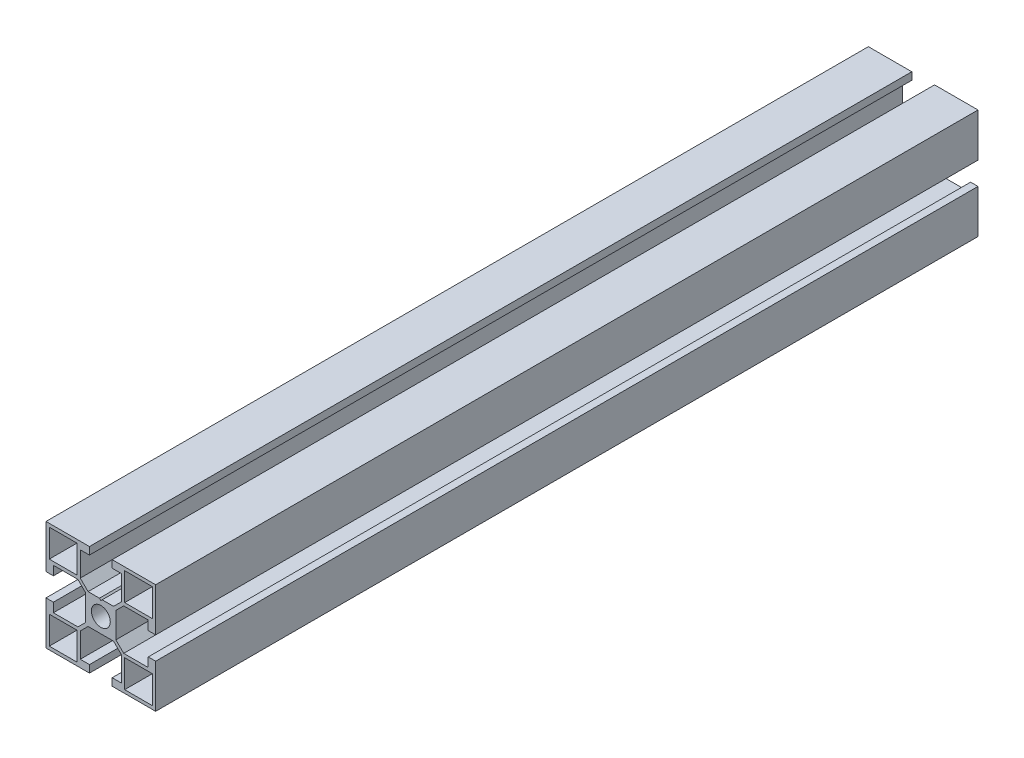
ISO-10303-21;
HEADER;
FILE_DESCRIPTION(('STEP AP214'),'2;1');
FILE_NAME('part.step','',(''),(''),'','','');
FILE_SCHEMA(('AUTOMOTIVE_DESIGN { 1 0 10303 214 1 1 1 1 }'));
ENDSEC;
DATA;
#1=APPLICATION_CONTEXT('core data for automotive mechanical design processes');
#2=APPLICATION_PROTOCOL_DEFINITION('international standard','automotive_design',2000,#1);
#3=PRODUCT_CONTEXT('',#1,'mechanical');
#4=PRODUCT('Part','Part','',(#3));
#5=PRODUCT_RELATED_PRODUCT_CATEGORY('part','',(#4));
#6=PRODUCT_DEFINITION_FORMATION('','',#4);
#7=PRODUCT_DEFINITION_CONTEXT('part definition',#1,'design');
#8=PRODUCT_DEFINITION('design','',#6,#7);
#9=PRODUCT_DEFINITION_SHAPE('','',#8);
#10=(LENGTH_UNIT() NAMED_UNIT(*) SI_UNIT(.MILLI.,.METRE.));
#11=(NAMED_UNIT(*) PLANE_ANGLE_UNIT() SI_UNIT($,.RADIAN.));
#12=(NAMED_UNIT(*) SI_UNIT($,.STERADIAN.) SOLID_ANGLE_UNIT());
#13=UNCERTAINTY_MEASURE_WITH_UNIT(LENGTH_MEASURE(1.E-05),#10,'distance_accuracy_value','');
#14=(GEOMETRIC_REPRESENTATION_CONTEXT(3) GLOBAL_UNCERTAINTY_ASSIGNED_CONTEXT((#13)) GLOBAL_UNIT_ASSIGNED_CONTEXT((#10,
#11,#12)) REPRESENTATION_CONTEXT('',''));
#15=CARTESIAN_POINT('',(0.,0.,0.));
#16=DIRECTION('',(0.,0.,1.));
#17=DIRECTION('',(1.,0.,0.));
#18=AXIS2_PLACEMENT_3D('',#15,#16,#17);
#19=CARTESIAN_POINT('',(0.,0.,300.));
#20=DIRECTION('',(0.,0.,-1.));
#21=DIRECTION('',(-1.,0.,0.));
#22=AXIS2_PLACEMENT_3D('',#19,#20,#21);
#23=PLANE('',#22);
#24=DIRECTION('',(0.,-1.,0.));
#25=VECTOR('',#24,1.);
#26=CARTESIAN_POINT('',(4808.07622994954,1507.05030583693,300.));
#27=LINE('',#26,#25);
#28=CARTESIAN_POINT('',(4808.07622994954,1507.05030583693,300.));
#29=VERTEX_POINT('',#28);
#30=CARTESIAN_POINT('',(4808.07622994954,1496.95030583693,300.));
#31=VERTEX_POINT('',#30);
#32=EDGE_CURVE('E464',#29,#31,#27,.T.);
#33=ORIENTED_EDGE('',*,*,#32,.F.);
#34=DIRECTION('',(-1.,0.,0.));
#35=VECTOR('',#34,1.);
#36=CARTESIAN_POINT('',(4818.17622994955,1507.05030583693,300.));
#37=LINE('',#36,#35);
#38=CARTESIAN_POINT('',(4818.17622994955,1507.05030583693,300.));
#39=VERTEX_POINT('',#38);
#40=EDGE_CURVE('E472',#39,#29,#37,.T.);
#41=ORIENTED_EDGE('',*,*,#40,.F.);
#42=DIRECTION('',(0.,1.,0.));
#43=VECTOR('',#42,1.);
#44=CARTESIAN_POINT('',(4818.17622994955,1496.95030583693,300.));
#45=LINE('',#44,#43);
#46=CARTESIAN_POINT('',(4818.17622994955,1496.95030583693,300.));
#47=VERTEX_POINT('',#46);
#48=EDGE_CURVE('E469',#47,#39,#45,.T.);
#49=ORIENTED_EDGE('',*,*,#48,.F.);
#50=DIRECTION('',(1.,0.,0.));
#51=VECTOR('',#50,1.);
#52=CARTESIAN_POINT('',(4808.07622994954,1496.95030583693,300.));
#53=LINE('',#52,#51);
#54=EDGE_CURVE('E466',#31,#47,#53,.T.);
#55=ORIENTED_EDGE('',*,*,#54,.F.);
#56=EDGE_LOOP('',(#33,#41,#49,#55));
#57=FACE_BOUND('',#56,.T.);
#58=DIRECTION('',(0.,1.,0.));
#59=VECTOR('',#58,1.);
#60=CARTESIAN_POINT('',(4845.67622994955,1524.45030583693,300.));
#61=LINE('',#60,#59);
#62=CARTESIAN_POINT('',(4845.67622994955,1524.45030583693,300.));
#63=VERTEX_POINT('',#62);
#64=CARTESIAN_POINT('',(4845.67622994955,1534.55030583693,300.));
#65=VERTEX_POINT('',#64);
#66=EDGE_CURVE('E526',#63,#65,#61,.T.);
#67=ORIENTED_EDGE('',*,*,#66,.F.);
#68=DIRECTION('',(1.,0.,0.));
#69=VECTOR('',#68,1.);
#70=CARTESIAN_POINT('',(4835.57622994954,1524.45030583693,300.));
#71=LINE('',#70,#69);
#72=CARTESIAN_POINT('',(4835.57622994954,1524.45030583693,300.));
#73=VERTEX_POINT('',#72);
#74=EDGE_CURVE('E534',#73,#63,#71,.T.);
#75=ORIENTED_EDGE('',*,*,#74,.F.);
#76=DIRECTION('',(0.,-1.,0.));
#77=VECTOR('',#76,1.);
#78=CARTESIAN_POINT('',(4835.57622994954,1534.55030583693,300.));
#79=LINE('',#78,#77);
#80=CARTESIAN_POINT('',(4835.57622994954,1534.55030583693,300.));
#81=VERTEX_POINT('',#80);
#82=EDGE_CURVE('E531',#81,#73,#79,.T.);
#83=ORIENTED_EDGE('',*,*,#82,.F.);
#84=DIRECTION('',(-1.,0.,0.));
#85=VECTOR('',#84,1.);
#86=CARTESIAN_POINT('',(4845.67622994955,1534.55030583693,300.));
#87=LINE('',#86,#85);
#88=EDGE_CURVE('E528',#65,#81,#87,.T.);
#89=ORIENTED_EDGE('',*,*,#88,.F.);
#90=EDGE_LOOP('',(#67,#75,#83,#89));
#91=FACE_BOUND('',#90,.T.);
#92=DIRECTION('',(-1.,0.,0.));
#93=VECTOR('',#92,1.);
#94=CARTESIAN_POINT('',(4831.52770181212,1521.25030583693,300.));
#95=LINE('',#94,#93);
#96=CARTESIAN_POINT('',(4831.52770181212,1521.25030583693,300.));
#97=VERTEX_POINT('',#96);
#98=CARTESIAN_POINT('',(4827.37622994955,1521.25030583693,300.));
#99=VERTEX_POINT('',#98);
#100=EDGE_CURVE('E563',#97,#99,#95,.T.);
#101=ORIENTED_EDGE('',*,*,#100,.T.);
#102=DIRECTION('',(-0.707106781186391,-0.707106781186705,0.));
#103=VECTOR('',#102,1.);
#104=CARTESIAN_POINT('',(4827.37622994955,1521.25030583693,300.));
#105=LINE('',#104,#103);
#106=CARTESIAN_POINT('',(4826.87622994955,1520.75030583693,300.));
#107=VERTEX_POINT('',#106);
#108=EDGE_CURVE('E566',#99,#107,#105,.T.);
#109=ORIENTED_EDGE('',*,*,#108,.T.);
#110=DIRECTION('',(-0.707106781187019,0.707106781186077,0.));
#111=VECTOR('',#110,1.);
#112=CARTESIAN_POINT('',(4826.87622994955,1520.75030583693,300.));
#113=LINE('',#112,#111);
#114=CARTESIAN_POINT('',(4826.37622994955,1521.25030583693,300.));
#115=VERTEX_POINT('',#114);
#116=EDGE_CURVE('E569',#107,#115,#113,.T.);
#117=ORIENTED_EDGE('',*,*,#116,.T.);
#118=DIRECTION('',(-1.,0.,0.));
#119=VECTOR('',#118,1.);
#120=CARTESIAN_POINT('',(4826.37622994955,1521.25030583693,300.));
#121=LINE('',#120,#119);
#122=CARTESIAN_POINT('',(4822.22475808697,1521.25030583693,300.));
#123=VERTEX_POINT('',#122);
#124=EDGE_CURVE('E571',#115,#123,#121,.T.);
#125=ORIENTED_EDGE('',*,*,#124,.T.);
#126=DIRECTION('',(-0.707106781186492,0.707106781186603,0.));
#127=VECTOR('',#126,1.);
#128=CARTESIAN_POINT('',(4822.22475808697,1521.25030583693,300.));
#129=LINE('',#128,#127);
#130=CARTESIAN_POINT('',(4819.37622994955,1524.09883397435,300.));
#131=VERTEX_POINT('',#130);
#132=EDGE_CURVE('E573',#123,#131,#129,.T.);
#133=ORIENTED_EDGE('',*,*,#132,.T.);
#134=DIRECTION('',(0.,1.,0.));
#135=VECTOR('',#134,1.);
#136=CARTESIAN_POINT('',(4819.37622994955,1524.09883397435,300.));
#137=LINE('',#136,#135);
#138=CARTESIAN_POINT('',(4819.37622994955,1533.05030583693,300.));
#139=VERTEX_POINT('',#138);
#140=EDGE_CURVE('E575',#131,#139,#137,.T.);
#141=ORIENTED_EDGE('',*,*,#140,.T.);
#142=DIRECTION('',(1.,0.,0.));
#143=VECTOR('',#142,1.);
#144=CARTESIAN_POINT('',(4819.37622994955,1533.05030583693,300.));
#145=LINE('',#144,#143);
#146=CARTESIAN_POINT('',(4822.72622994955,1533.05030583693,300.));
#147=VERTEX_POINT('',#146);
#148=EDGE_CURVE('E577',#139,#147,#145,.T.);
#149=ORIENTED_EDGE('',*,*,#148,.T.);
#150=DIRECTION('',(0.,1.,0.));
#151=VECTOR('',#150,1.);
#152=CARTESIAN_POINT('',(4822.72622994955,1533.05030583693,300.));
#153=LINE('',#152,#151);
#154=CARTESIAN_POINT('',(4822.72622994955,1535.75030583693,300.));
#155=VERTEX_POINT('',#154);
#156=EDGE_CURVE('E579',#147,#155,#153,.T.);
#157=ORIENTED_EDGE('',*,*,#156,.T.);
#158=DIRECTION('',(-1.,0.,0.));
#159=VECTOR('',#158,1.);
#160=CARTESIAN_POINT('',(4822.72622994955,1535.75030583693,300.));
#161=LINE('',#160,#159);
#162=CARTESIAN_POINT('',(4806.87622994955,1535.75030583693,300.));
#163=VERTEX_POINT('',#162);
#164=EDGE_CURVE('E581',#155,#163,#161,.T.);
#165=ORIENTED_EDGE('',*,*,#164,.T.);
#166=DIRECTION('',(0.,-1.,0.));
#167=VECTOR('',#166,1.);
#168=CARTESIAN_POINT('',(4806.87622994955,1535.75030583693,300.));
#169=LINE('',#168,#167);
#170=CARTESIAN_POINT('',(4806.87622994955,1519.90030583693,300.));
#171=VERTEX_POINT('',#170);
#172=EDGE_CURVE('E583',#163,#171,#169,.T.);
#173=ORIENTED_EDGE('',*,*,#172,.T.);
#174=DIRECTION('',(1.,0.,0.));
#175=VECTOR('',#174,1.);
#176=CARTESIAN_POINT('',(4806.87622994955,1519.90030583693,300.));
#177=LINE('',#176,#175);
#178=CARTESIAN_POINT('',(4809.57622994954,1519.90030583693,300.));
#179=VERTEX_POINT('',#178);
#180=EDGE_CURVE('E585',#171,#179,#177,.T.);
#181=ORIENTED_EDGE('',*,*,#180,.T.);
#182=DIRECTION('',(0.,1.,0.));
#183=VECTOR('',#182,1.);
#184=CARTESIAN_POINT('',(4809.57622994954,1519.90030583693,300.));
#185=LINE('',#184,#183);
#186=CARTESIAN_POINT('',(4809.57622994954,1523.25030583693,300.));
#187=VERTEX_POINT('',#186);
#188=EDGE_CURVE('E587',#179,#187,#185,.T.);
#189=ORIENTED_EDGE('',*,*,#188,.T.);
#190=DIRECTION('',(1.,0.,0.));
#191=VECTOR('',#190,1.);
#192=CARTESIAN_POINT('',(4809.57622994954,1523.25030583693,300.));
#193=LINE('',#192,#191);
#194=CARTESIAN_POINT('',(4818.52770181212,1523.25030583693,300.));
#195=VERTEX_POINT('',#194);
#196=EDGE_CURVE('E589',#187,#195,#193,.T.);
#197=ORIENTED_EDGE('',*,*,#196,.T.);
#198=DIRECTION('',(0.707106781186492,-0.707106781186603,0.));
#199=VECTOR('',#198,1.);
#200=CARTESIAN_POINT('',(4818.52770181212,1523.25030583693,300.));
#201=LINE('',#200,#199);
#202=CARTESIAN_POINT('',(4821.37622994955,1520.40177769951,300.));
#203=VERTEX_POINT('',#202);
#204=EDGE_CURVE('E591',#195,#203,#201,.T.);
#205=ORIENTED_EDGE('',*,*,#204,.T.);
#206=DIRECTION('',(0.,-1.,0.));
#207=VECTOR('',#206,1.);
#208=CARTESIAN_POINT('',(4821.37622994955,1520.40177769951,300.));
#209=LINE('',#208,#207);
#210=CARTESIAN_POINT('',(4821.37622994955,1511.09883397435,300.));
#211=VERTEX_POINT('',#210);
#212=EDGE_CURVE('E593',#203,#211,#209,.T.);
#213=ORIENTED_EDGE('',*,*,#212,.T.);
#214=DIRECTION('',(-0.707106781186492,-0.707106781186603,0.));
#215=VECTOR('',#214,1.);
#216=CARTESIAN_POINT('',(4821.37622994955,1511.09883397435,300.));
#217=LINE('',#216,#215);
#218=CARTESIAN_POINT('',(4818.52770181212,1508.25030583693,300.));
#219=VERTEX_POINT('',#218);
#220=EDGE_CURVE('E595',#211,#219,#217,.T.);
#221=ORIENTED_EDGE('',*,*,#220,.T.);
#222=DIRECTION('',(-1.,0.,0.));
#223=VECTOR('',#222,1.);
#224=CARTESIAN_POINT('',(4818.52770181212,1508.25030583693,300.));
#225=LINE('',#224,#223);
#226=CARTESIAN_POINT('',(4809.57622994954,1508.25030583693,300.));
#227=VERTEX_POINT('',#226);
#228=EDGE_CURVE('E597',#219,#227,#225,.T.);
#229=ORIENTED_EDGE('',*,*,#228,.T.);
#230=DIRECTION('',(0.,1.,0.));
#231=VECTOR('',#230,1.);
#232=CARTESIAN_POINT('',(4809.57622994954,1508.25030583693,300.));
#233=LINE('',#232,#231);
#234=CARTESIAN_POINT('',(4809.57622994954,1511.60030583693,300.));
#235=VERTEX_POINT('',#234);
#236=EDGE_CURVE('E599',#227,#235,#233,.T.);
#237=ORIENTED_EDGE('',*,*,#236,.T.);
#238=DIRECTION('',(-1.,0.,0.));
#239=VECTOR('',#238,1.);
#240=CARTESIAN_POINT('',(4809.57622994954,1511.60030583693,300.));
#241=LINE('',#240,#239);
#242=CARTESIAN_POINT('',(4806.87622994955,1511.60030583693,300.));
#243=VERTEX_POINT('',#242);
#244=EDGE_CURVE('E601',#235,#243,#241,.T.);
#245=ORIENTED_EDGE('',*,*,#244,.T.);
#246=DIRECTION('',(0.,-1.,0.));
#247=VECTOR('',#246,1.);
#248=CARTESIAN_POINT('',(4806.87622994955,1511.60030583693,300.));
#249=LINE('',#248,#247);
#250=CARTESIAN_POINT('',(4806.87622994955,1495.75030583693,300.));
#251=VERTEX_POINT('',#250);
#252=EDGE_CURVE('E603',#243,#251,#249,.T.);
#253=ORIENTED_EDGE('',*,*,#252,.T.);
#254=DIRECTION('',(1.,0.,0.));
#255=VECTOR('',#254,1.);
#256=CARTESIAN_POINT('',(4806.87622994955,1495.75030583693,300.));
#257=LINE('',#256,#255);
#258=CARTESIAN_POINT('',(4822.72622994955,1495.75030583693,300.));
#259=VERTEX_POINT('',#258);
#260=EDGE_CURVE('E605',#251,#259,#257,.T.);
#261=ORIENTED_EDGE('',*,*,#260,.T.);
#262=DIRECTION('',(0.,1.,0.));
#263=VECTOR('',#262,1.);
#264=CARTESIAN_POINT('',(4822.72622994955,1495.75030583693,300.));
#265=LINE('',#264,#263);
#266=CARTESIAN_POINT('',(4822.72622994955,1498.45030583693,300.));
#267=VERTEX_POINT('',#266);
#268=EDGE_CURVE('E607',#259,#267,#265,.T.);
#269=ORIENTED_EDGE('',*,*,#268,.T.);
#270=DIRECTION('',(-1.,0.,0.));
#271=VECTOR('',#270,1.);
#272=CARTESIAN_POINT('',(4822.72622994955,1498.45030583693,300.));
#273=LINE('',#272,#271);
#274=CARTESIAN_POINT('',(4819.37622994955,1498.45030583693,300.));
#275=VERTEX_POINT('',#274);
#276=EDGE_CURVE('E609',#267,#275,#273,.T.);
#277=ORIENTED_EDGE('',*,*,#276,.T.);
#278=DIRECTION('',(0.,1.,0.));
#279=VECTOR('',#278,1.);
#280=CARTESIAN_POINT('',(4819.37622994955,1498.45030583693,300.));
#281=LINE('',#280,#279);
#282=CARTESIAN_POINT('',(4819.37622994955,1507.40177769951,300.));
#283=VERTEX_POINT('',#282);
#284=EDGE_CURVE('E611',#275,#283,#281,.T.);
#285=ORIENTED_EDGE('',*,*,#284,.T.);
#286=DIRECTION('',(0.707106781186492,0.707106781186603,0.));
#287=VECTOR('',#286,1.);
#288=CARTESIAN_POINT('',(4819.37622994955,1507.40177769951,300.));
#289=LINE('',#288,#287);
#290=CARTESIAN_POINT('',(4822.22475808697,1510.25030583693,300.));
#291=VERTEX_POINT('',#290);
#292=EDGE_CURVE('E613',#283,#291,#289,.T.);
#293=ORIENTED_EDGE('',*,*,#292,.T.);
#294=DIRECTION('',(1.,0.,0.));
#295=VECTOR('',#294,1.);
#296=CARTESIAN_POINT('',(4822.22475808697,1510.25030583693,300.));
#297=LINE('',#296,#295);
#298=CARTESIAN_POINT('',(4831.52770181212,1510.25030583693,300.));
#299=VERTEX_POINT('',#298);
#300=EDGE_CURVE('E615',#291,#299,#297,.T.);
#301=ORIENTED_EDGE('',*,*,#300,.T.);
#302=DIRECTION('',(0.707106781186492,-0.707106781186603,0.));
#303=VECTOR('',#302,1.);
#304=CARTESIAN_POINT('',(4831.52770181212,1510.25030583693,300.));
#305=LINE('',#304,#303);
#306=CARTESIAN_POINT('',(4834.37622994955,1507.40177769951,300.));
#307=VERTEX_POINT('',#306);
#308=EDGE_CURVE('E617',#299,#307,#305,.T.);
#309=ORIENTED_EDGE('',*,*,#308,.T.);
#310=DIRECTION('',(0.,-1.,0.));
#311=VECTOR('',#310,1.);
#312=CARTESIAN_POINT('',(4834.37622994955,1507.40177769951,300.));
#313=LINE('',#312,#311);
#314=CARTESIAN_POINT('',(4834.37622994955,1498.45030583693,300.));
#315=VERTEX_POINT('',#314);
#316=EDGE_CURVE('E619',#307,#315,#313,.T.);
#317=ORIENTED_EDGE('',*,*,#316,.T.);
#318=DIRECTION('',(-1.,0.,0.));
#319=VECTOR('',#318,1.);
#320=CARTESIAN_POINT('',(4834.37622994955,1498.45030583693,300.));
#321=LINE('',#320,#319);
#322=CARTESIAN_POINT('',(4831.02622994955,1498.45030583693,300.));
#323=VERTEX_POINT('',#322);
#324=EDGE_CURVE('E621',#315,#323,#321,.T.);
#325=ORIENTED_EDGE('',*,*,#324,.T.);
#326=DIRECTION('',(0.,-1.,0.));
#327=VECTOR('',#326,1.);
#328=CARTESIAN_POINT('',(4831.02622994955,1498.45030583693,300.));
#329=LINE('',#328,#327);
#330=CARTESIAN_POINT('',(4831.02622994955,1495.75030583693,300.));
#331=VERTEX_POINT('',#330);
#332=EDGE_CURVE('E623',#323,#331,#329,.T.);
#333=ORIENTED_EDGE('',*,*,#332,.T.);
#334=DIRECTION('',(1.,0.,0.));
#335=VECTOR('',#334,1.);
#336=CARTESIAN_POINT('',(4831.02622994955,1495.75030583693,300.));
#337=LINE('',#336,#335);
#338=CARTESIAN_POINT('',(4846.87622994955,1495.75030583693,300.));
#339=VERTEX_POINT('',#338);
#340=EDGE_CURVE('E625',#331,#339,#337,.T.);
#341=ORIENTED_EDGE('',*,*,#340,.T.);
#342=DIRECTION('',(0.,1.,0.));
#343=VECTOR('',#342,1.);
#344=CARTESIAN_POINT('',(4846.87622994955,1495.75030583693,300.));
#345=LINE('',#344,#343);
#346=CARTESIAN_POINT('',(4846.87622994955,1511.60030583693,300.));
#347=VERTEX_POINT('',#346);
#348=EDGE_CURVE('E627',#339,#347,#345,.T.);
#349=ORIENTED_EDGE('',*,*,#348,.T.);
#350=DIRECTION('',(-1.,0.,0.));
#351=VECTOR('',#350,1.);
#352=CARTESIAN_POINT('',(4846.87622994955,1511.60030583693,300.));
#353=LINE('',#352,#351);
#354=CARTESIAN_POINT('',(4844.17622994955,1511.60030583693,300.));
#355=VERTEX_POINT('',#354);
#356=EDGE_CURVE('E629',#347,#355,#353,.T.);
#357=ORIENTED_EDGE('',*,*,#356,.T.);
#358=DIRECTION('',(0.,-1.,0.));
#359=VECTOR('',#358,1.);
#360=CARTESIAN_POINT('',(4844.17622994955,1511.60030583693,300.));
#361=LINE('',#360,#359);
#362=CARTESIAN_POINT('',(4844.17622994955,1508.25030583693,300.));
#363=VERTEX_POINT('',#362);
#364=EDGE_CURVE('E631',#355,#363,#361,.T.);
#365=ORIENTED_EDGE('',*,*,#364,.T.);
#366=DIRECTION('',(-1.,0.,0.));
#367=VECTOR('',#366,1.);
#368=CARTESIAN_POINT('',(4844.17622994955,1508.25030583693,300.));
#369=LINE('',#368,#367);
#370=CARTESIAN_POINT('',(4835.22475808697,1508.25030583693,300.));
#371=VERTEX_POINT('',#370);
#372=EDGE_CURVE('E633',#363,#371,#369,.T.);
#373=ORIENTED_EDGE('',*,*,#372,.T.);
#374=DIRECTION('',(-0.707106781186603,0.707106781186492,0.));
#375=VECTOR('',#374,1.);
#376=CARTESIAN_POINT('',(4835.22475808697,1508.25030583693,300.));
#377=LINE('',#376,#375);
#378=CARTESIAN_POINT('',(4832.37622994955,1511.09883397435,300.));
#379=VERTEX_POINT('',#378);
#380=EDGE_CURVE('E635',#371,#379,#377,.T.);
#381=ORIENTED_EDGE('',*,*,#380,.T.);
#382=DIRECTION('',(0.,1.,0.));
#383=VECTOR('',#382,1.);
#384=CARTESIAN_POINT('',(4832.37622994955,1511.09883397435,300.));
#385=LINE('',#384,#383);
#386=CARTESIAN_POINT('',(4832.37622994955,1520.40177769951,300.));
#387=VERTEX_POINT('',#386);
#388=EDGE_CURVE('E637',#379,#387,#385,.T.);
#389=ORIENTED_EDGE('',*,*,#388,.T.);
#390=DIRECTION('',(0.707106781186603,0.707106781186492,0.));
#391=VECTOR('',#390,1.);
#392=CARTESIAN_POINT('',(4832.37622994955,1520.40177769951,300.));
#393=LINE('',#392,#391);
#394=CARTESIAN_POINT('',(4835.22475808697,1523.25030583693,300.));
#395=VERTEX_POINT('',#394);
#396=EDGE_CURVE('E639',#387,#395,#393,.T.);
#397=ORIENTED_EDGE('',*,*,#396,.T.);
#398=DIRECTION('',(1.,0.,0.));
#399=VECTOR('',#398,1.);
#400=CARTESIAN_POINT('',(4835.22475808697,1523.25030583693,300.));
#401=LINE('',#400,#399);
#402=CARTESIAN_POINT('',(4844.17622994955,1523.25030583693,300.));
#403=VERTEX_POINT('',#402);
#404=EDGE_CURVE('E641',#395,#403,#401,.T.);
#405=ORIENTED_EDGE('',*,*,#404,.T.);
#406=DIRECTION('',(0.,-1.,0.));
#407=VECTOR('',#406,1.);
#408=CARTESIAN_POINT('',(4844.17622994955,1523.25030583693,300.));
#409=LINE('',#408,#407);
#410=CARTESIAN_POINT('',(4844.17622994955,1519.90030583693,300.));
#411=VERTEX_POINT('',#410);
#412=EDGE_CURVE('E643',#403,#411,#409,.T.);
#413=ORIENTED_EDGE('',*,*,#412,.T.);
#414=DIRECTION('',(1.,0.,0.));
#415=VECTOR('',#414,1.);
#416=CARTESIAN_POINT('',(4844.17622994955,1519.90030583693,300.));
#417=LINE('',#416,#415);
#418=CARTESIAN_POINT('',(4846.87622994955,1519.90030583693,300.));
#419=VERTEX_POINT('',#418);
#420=EDGE_CURVE('E645',#411,#419,#417,.T.);
#421=ORIENTED_EDGE('',*,*,#420,.T.);
#422=DIRECTION('',(0.,1.,0.));
#423=VECTOR('',#422,1.);
#424=CARTESIAN_POINT('',(4846.87622994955,1519.90030583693,300.));
#425=LINE('',#424,#423);
#426=CARTESIAN_POINT('',(4846.87622994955,1535.75030583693,300.));
#427=VERTEX_POINT('',#426);
#428=EDGE_CURVE('E647',#419,#427,#425,.T.);
#429=ORIENTED_EDGE('',*,*,#428,.T.);
#430=DIRECTION('',(-1.,0.,0.));
#431=VECTOR('',#430,1.);
#432=CARTESIAN_POINT('',(4846.87622994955,1535.75030583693,300.));
#433=LINE('',#432,#431);
#434=CARTESIAN_POINT('',(4831.02622994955,1535.75030583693,300.));
#435=VERTEX_POINT('',#434);
#436=EDGE_CURVE('E649',#427,#435,#433,.T.);
#437=ORIENTED_EDGE('',*,*,#436,.T.);
#438=DIRECTION('',(0.,-1.,0.));
#439=VECTOR('',#438,1.);
#440=CARTESIAN_POINT('',(4831.02622994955,1535.75030583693,300.));
#441=LINE('',#440,#439);
#442=CARTESIAN_POINT('',(4831.02622994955,1533.05030583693,300.));
#443=VERTEX_POINT('',#442);
#444=EDGE_CURVE('E651',#435,#443,#441,.T.);
#445=ORIENTED_EDGE('',*,*,#444,.T.);
#446=DIRECTION('',(1.,0.,0.));
#447=VECTOR('',#446,1.);
#448=CARTESIAN_POINT('',(4831.02622994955,1533.05030583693,300.));
#449=LINE('',#448,#447);
#450=CARTESIAN_POINT('',(4834.37622994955,1533.05030583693,300.));
#451=VERTEX_POINT('',#450);
#452=EDGE_CURVE('E653',#443,#451,#449,.T.);
#453=ORIENTED_EDGE('',*,*,#452,.T.);
#454=DIRECTION('',(0.,-1.,0.));
#455=VECTOR('',#454,1.);
#456=CARTESIAN_POINT('',(4834.37622994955,1533.05030583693,300.));
#457=LINE('',#456,#455);
#458=CARTESIAN_POINT('',(4834.37622994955,1524.09883397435,300.));
#459=VERTEX_POINT('',#458);
#460=EDGE_CURVE('E655',#451,#459,#457,.T.);
#461=ORIENTED_EDGE('',*,*,#460,.T.);
#462=DIRECTION('',(-0.707106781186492,-0.707106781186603,0.));
#463=VECTOR('',#462,1.);
#464=CARTESIAN_POINT('',(4834.37622994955,1524.09883397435,300.));
#465=LINE('',#464,#463);
#466=EDGE_CURVE('E657',#459,#97,#465,.T.);
#467=ORIENTED_EDGE('',*,*,#466,.T.);
#468=EDGE_LOOP('',(#101,#109,#117,#125,#133,#141,#149,#157,#165,#173,#181,#189,#197,#205,#213,
#221,#229,#237,#245,#253,#261,#269,#277,#285,#293,#301,#309,#317,#325,#333,#341,#349,#357,#365,
#373,#381,#389,#397,#405,#413,#421,#429,#437,#445,#453,#461,#467));
#469=FACE_BOUND('',#468,.T.);
#470=CARTESIAN_POINT('',(4826.87622994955,1515.75030583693,300.));
#471=DIRECTION('',(0.,0.,1.));
#472=DIRECTION('',(1.,0.,0.));
#473=AXIS2_PLACEMENT_3D('',#470,#471,#472);
#474=CIRCLE('',#473,3.44999999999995);
#475=CARTESIAN_POINT('',(4830.32622994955,1515.75030583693,300.));
#476=VERTEX_POINT('',#475);
#477=EDGE_CURVE('E557',#476,#476,#474,.T.);
#478=ORIENTED_EDGE('',*,*,#477,.F.);
#479=EDGE_LOOP('',(#478));
#480=FACE_BOUND('',#479,.T.);
#481=DIRECTION('',(0.,1.,0.));
#482=VECTOR('',#481,1.);
#483=CARTESIAN_POINT('',(4818.17622994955,1524.45030583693,300.));
#484=LINE('',#483,#482);
#485=CARTESIAN_POINT('',(4818.17622994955,1524.45030583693,300.));
#486=VERTEX_POINT('',#485);
#487=CARTESIAN_POINT('',(4818.17622994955,1534.55030583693,300.));
#488=VERTEX_POINT('',#487);
#489=EDGE_CURVE('E495',#486,#488,#484,.T.);
#490=ORIENTED_EDGE('',*,*,#489,.F.);
#491=DIRECTION('',(1.,0.,0.));
#492=VECTOR('',#491,1.);
#493=CARTESIAN_POINT('',(4808.07622994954,1524.45030583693,300.));
#494=LINE('',#493,#492);
#495=CARTESIAN_POINT('',(4808.07622994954,1524.45030583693,300.));
#496=VERTEX_POINT('',#495);
#497=EDGE_CURVE('E503',#496,#486,#494,.T.);
#498=ORIENTED_EDGE('',*,*,#497,.F.);
#499=DIRECTION('',(0.,-1.,0.));
#500=VECTOR('',#499,1.);
#501=CARTESIAN_POINT('',(4808.07622994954,1534.55030583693,300.));
#502=LINE('',#501,#500);
#503=CARTESIAN_POINT('',(4808.07622994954,1534.55030583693,300.));
#504=VERTEX_POINT('',#503);
#505=EDGE_CURVE('E500',#504,#496,#502,.T.);
#506=ORIENTED_EDGE('',*,*,#505,.F.);
#507=DIRECTION('',(-1.,0.,0.));
#508=VECTOR('',#507,1.);
#509=CARTESIAN_POINT('',(4818.17622994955,1534.55030583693,300.));
#510=LINE('',#509,#508);
#511=EDGE_CURVE('E497',#488,#504,#510,.T.);
#512=ORIENTED_EDGE('',*,*,#511,.F.);
#513=EDGE_LOOP('',(#490,#498,#506,#512));
#514=FACE_BOUND('',#513,.T.);
#515=DIRECTION('',(0.,-1.,0.));
#516=VECTOR('',#515,1.);
#517=CARTESIAN_POINT('',(4835.57622994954,1507.05030583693,300.));
#518=LINE('',#517,#516);
#519=CARTESIAN_POINT('',(4835.57622994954,1507.05030583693,300.));
#520=VERTEX_POINT('',#519);
#521=CARTESIAN_POINT('',(4835.57622994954,1496.95030583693,300.));
#522=VERTEX_POINT('',#521);
#523=EDGE_CURVE('E428',#520,#522,#518,.T.);
#524=ORIENTED_EDGE('',*,*,#523,.F.);
#525=DIRECTION('',(-1.,0.,0.));
#526=VECTOR('',#525,1.);
#527=CARTESIAN_POINT('',(4845.67622994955,1507.05030583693,300.));
#528=LINE('',#527,#526);
#529=CARTESIAN_POINT('',(4845.67622994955,1507.05030583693,300.));
#530=VERTEX_POINT('',#529);
#531=EDGE_CURVE('E450',#530,#520,#528,.T.);
#532=ORIENTED_EDGE('',*,*,#531,.F.);
#533=DIRECTION('',(0.,1.,0.));
#534=VECTOR('',#533,1.);
#535=CARTESIAN_POINT('',(4845.67622994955,1496.95030583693,300.));
#536=LINE('',#535,#534);
#537=CARTESIAN_POINT('',(4845.67622994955,1496.95030583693,300.));
#538=VERTEX_POINT('',#537);
#539=EDGE_CURVE('E448',#538,#530,#536,.T.);
#540=ORIENTED_EDGE('',*,*,#539,.F.);
#541=DIRECTION('',(1.,0.,0.));
#542=VECTOR('',#541,1.);
#543=CARTESIAN_POINT('',(4835.57622994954,1496.95030583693,300.));
#544=LINE('',#543,#542);
#545=EDGE_CURVE('E436',#522,#538,#544,.T.);
#546=ORIENTED_EDGE('',*,*,#545,.F.);
#547=EDGE_LOOP('',(#524,#532,#540,#546));
#548=FACE_BOUND('',#547,.T.);
#549=ADVANCED_FACE('F33',(#57,#91,#469,#480,#514,#548),#23,.F.);
#550=CARTESIAN_POINT('',(0.,0.,0.));
#551=DIRECTION('',(0.,0.,-1.));
#552=DIRECTION('',(-1.,0.,0.));
#553=AXIS2_PLACEMENT_3D('',#550,#551,#552);
#554=PLANE('',#553);
#555=DIRECTION('',(-1.,0.,0.));
#556=VECTOR('',#555,1.);
#557=CARTESIAN_POINT('',(4818.17622994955,1507.05030583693,0.));
#558=LINE('',#557,#556);
#559=CARTESIAN_POINT('',(4818.17622994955,1507.05030583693,0.));
#560=VERTEX_POINT('',#559);
#561=CARTESIAN_POINT('',(4808.07622994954,1507.05030583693,0.));
#562=VERTEX_POINT('',#561);
#563=EDGE_CURVE('E467',#560,#562,#558,.T.);
#564=ORIENTED_EDGE('',*,*,#563,.T.);
#565=DIRECTION('',(0.,-1.,0.));
#566=VECTOR('',#565,1.);
#567=CARTESIAN_POINT('',(4808.07622994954,1507.05030583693,0.));
#568=LINE('',#567,#566);
#569=CARTESIAN_POINT('',(4808.07622994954,1496.95030583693,0.));
#570=VERTEX_POINT('',#569);
#571=EDGE_CURVE('E444',#562,#570,#568,.T.);
#572=ORIENTED_EDGE('',*,*,#571,.T.);
#573=DIRECTION('',(1.,0.,0.));
#574=VECTOR('',#573,1.);
#575=CARTESIAN_POINT('',(4808.07622994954,1496.95030583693,0.));
#576=LINE('',#575,#574);
#577=CARTESIAN_POINT('',(4818.17622994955,1496.95030583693,0.));
#578=VERTEX_POINT('',#577);
#579=EDGE_CURVE('E477',#570,#578,#576,.T.);
#580=ORIENTED_EDGE('',*,*,#579,.T.);
#581=DIRECTION('',(0.,1.,0.));
#582=VECTOR('',#581,1.);
#583=CARTESIAN_POINT('',(4818.17622994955,1496.95030583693,0.));
#584=LINE('',#583,#582);
#585=EDGE_CURVE('E480',#578,#560,#584,.T.);
#586=ORIENTED_EDGE('',*,*,#585,.T.);
#587=EDGE_LOOP('',(#564,#572,#580,#586));
#588=FACE_BOUND('',#587,.T.);
#589=DIRECTION('',(1.,0.,0.));
#590=VECTOR('',#589,1.);
#591=CARTESIAN_POINT('',(4835.57622994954,1524.45030583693,0.));
#592=LINE('',#591,#590);
#593=CARTESIAN_POINT('',(4835.57622994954,1524.45030583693,0.));
#594=VERTEX_POINT('',#593);
#595=CARTESIAN_POINT('',(4845.67622994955,1524.45030583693,0.));
#596=VERTEX_POINT('',#595);
#597=EDGE_CURVE('E529',#594,#596,#592,.T.);
#598=ORIENTED_EDGE('',*,*,#597,.T.);
#599=DIRECTION('',(0.,1.,0.));
#600=VECTOR('',#599,1.);
#601=CARTESIAN_POINT('',(4845.67622994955,1524.45030583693,0.));
#602=LINE('',#601,#600);
#603=CARTESIAN_POINT('',(4845.67622994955,1534.55030583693,0.));
#604=VERTEX_POINT('',#603);
#605=EDGE_CURVE('E525',#596,#604,#602,.T.);
#606=ORIENTED_EDGE('',*,*,#605,.T.);
#607=DIRECTION('',(-1.,0.,0.));
#608=VECTOR('',#607,1.);
#609=CARTESIAN_POINT('',(4845.67622994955,1534.55030583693,0.));
#610=LINE('',#609,#608);
#611=CARTESIAN_POINT('',(4835.57622994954,1534.55030583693,0.));
#612=VERTEX_POINT('',#611);
#613=EDGE_CURVE('E539',#604,#612,#610,.T.);
#614=ORIENTED_EDGE('',*,*,#613,.T.);
#615=DIRECTION('',(0.,-1.,0.));
#616=VECTOR('',#615,1.);
#617=CARTESIAN_POINT('',(4835.57622994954,1534.55030583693,0.));
#618=LINE('',#617,#616);
#619=EDGE_CURVE('E542',#612,#594,#618,.T.);
#620=ORIENTED_EDGE('',*,*,#619,.T.);
#621=EDGE_LOOP('',(#598,#606,#614,#620));
#622=FACE_BOUND('',#621,.T.);
#623=DIRECTION('',(-1.,0.,0.));
#624=VECTOR('',#623,1.);
#625=CARTESIAN_POINT('',(4831.52770181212,1521.25030583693,0.));
#626=LINE('',#625,#624);
#627=CARTESIAN_POINT('',(4831.52770181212,1521.25030583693,0.));
#628=VERTEX_POINT('',#627);
#629=CARTESIAN_POINT('',(4827.37622994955,1521.25030583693,0.));
#630=VERTEX_POINT('',#629);
#631=EDGE_CURVE('E560',#628,#630,#626,.T.);
#632=ORIENTED_EDGE('',*,*,#631,.F.);
#633=DIRECTION('',(-0.707106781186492,-0.707106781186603,0.));
#634=VECTOR('',#633,1.);
#635=CARTESIAN_POINT('',(4834.37622994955,1524.09883397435,0.));
#636=LINE('',#635,#634);
#637=CARTESIAN_POINT('',(4834.37622994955,1524.09883397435,0.));
#638=VERTEX_POINT('',#637);
#639=EDGE_CURVE('E567',#638,#628,#636,.T.);
#640=ORIENTED_EDGE('',*,*,#639,.F.);
#641=DIRECTION('',(0.,-1.,0.));
#642=VECTOR('',#641,1.);
#643=CARTESIAN_POINT('',(4834.37622994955,1533.05030583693,0.));
#644=LINE('',#643,#642);
#645=CARTESIAN_POINT('',(4834.37622994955,1533.05030583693,0.));
#646=VERTEX_POINT('',#645);
#647=EDGE_CURVE('E750',#646,#638,#644,.T.);
#648=ORIENTED_EDGE('',*,*,#647,.F.);
#649=DIRECTION('',(1.,0.,0.));
#650=VECTOR('',#649,1.);
#651=CARTESIAN_POINT('',(4831.02622994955,1533.05030583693,0.));
#652=LINE('',#651,#650);
#653=CARTESIAN_POINT('',(4831.02622994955,1533.05030583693,0.));
#654=VERTEX_POINT('',#653);
#655=EDGE_CURVE('E748',#654,#646,#652,.T.);
#656=ORIENTED_EDGE('',*,*,#655,.F.);
#657=DIRECTION('',(0.,-1.,0.));
#658=VECTOR('',#657,1.);
#659=CARTESIAN_POINT('',(4831.02622994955,1535.75030583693,0.));
#660=LINE('',#659,#658);
#661=CARTESIAN_POINT('',(4831.02622994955,1535.75030583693,0.));
#662=VERTEX_POINT('',#661);
#663=EDGE_CURVE('E746',#662,#654,#660,.T.);
#664=ORIENTED_EDGE('',*,*,#663,.F.);
#665=DIRECTION('',(-1.,0.,0.));
#666=VECTOR('',#665,1.);
#667=CARTESIAN_POINT('',(4846.87622994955,1535.75030583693,0.));
#668=LINE('',#667,#666);
#669=CARTESIAN_POINT('',(4846.87622994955,1535.75030583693,0.));
#670=VERTEX_POINT('',#669);
#671=EDGE_CURVE('E744',#670,#662,#668,.T.);
#672=ORIENTED_EDGE('',*,*,#671,.F.);
#673=DIRECTION('',(0.,1.,0.));
#674=VECTOR('',#673,1.);
#675=CARTESIAN_POINT('',(4846.87622994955,1519.90030583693,0.));
#676=LINE('',#675,#674);
#677=CARTESIAN_POINT('',(4846.87622994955,1519.90030583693,0.));
#678=VERTEX_POINT('',#677);
#679=EDGE_CURVE('E742',#678,#670,#676,.T.);
#680=ORIENTED_EDGE('',*,*,#679,.F.);
#681=DIRECTION('',(1.,0.,0.));
#682=VECTOR('',#681,1.);
#683=CARTESIAN_POINT('',(4844.17622994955,1519.90030583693,0.));
#684=LINE('',#683,#682);
#685=CARTESIAN_POINT('',(4844.17622994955,1519.90030583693,0.));
#686=VERTEX_POINT('',#685);
#687=EDGE_CURVE('E740',#686,#678,#684,.T.);
#688=ORIENTED_EDGE('',*,*,#687,.F.);
#689=DIRECTION('',(0.,-1.,0.));
#690=VECTOR('',#689,1.);
#691=CARTESIAN_POINT('',(4844.17622994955,1523.25030583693,0.));
#692=LINE('',#691,#690);
#693=CARTESIAN_POINT('',(4844.17622994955,1523.25030583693,0.));
#694=VERTEX_POINT('',#693);
#695=EDGE_CURVE('E738',#694,#686,#692,.T.);
#696=ORIENTED_EDGE('',*,*,#695,.F.);
#697=DIRECTION('',(1.,0.,0.));
#698=VECTOR('',#697,1.);
#699=CARTESIAN_POINT('',(4835.22475808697,1523.25030583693,0.));
#700=LINE('',#699,#698);
#701=CARTESIAN_POINT('',(4835.22475808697,1523.25030583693,0.));
#702=VERTEX_POINT('',#701);
#703=EDGE_CURVE('E736',#702,#694,#700,.T.);
#704=ORIENTED_EDGE('',*,*,#703,.F.);
#705=DIRECTION('',(0.707106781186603,0.707106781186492,0.));
#706=VECTOR('',#705,1.);
#707=CARTESIAN_POINT('',(4832.37622994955,1520.40177769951,0.));
#708=LINE('',#707,#706);
#709=CARTESIAN_POINT('',(4832.37622994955,1520.40177769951,0.));
#710=VERTEX_POINT('',#709);
#711=EDGE_CURVE('E734',#710,#702,#708,.T.);
#712=ORIENTED_EDGE('',*,*,#711,.F.);
#713=DIRECTION('',(0.,1.,0.));
#714=VECTOR('',#713,1.);
#715=CARTESIAN_POINT('',(4832.37622994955,1511.09883397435,0.));
#716=LINE('',#715,#714);
#717=CARTESIAN_POINT('',(4832.37622994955,1511.09883397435,0.));
#718=VERTEX_POINT('',#717);
#719=EDGE_CURVE('E732',#718,#710,#716,.T.);
#720=ORIENTED_EDGE('',*,*,#719,.F.);
#721=DIRECTION('',(-0.707106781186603,0.707106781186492,0.));
#722=VECTOR('',#721,1.);
#723=CARTESIAN_POINT('',(4835.22475808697,1508.25030583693,0.));
#724=LINE('',#723,#722);
#725=CARTESIAN_POINT('',(4835.22475808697,1508.25030583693,0.));
#726=VERTEX_POINT('',#725);
#727=EDGE_CURVE('E730',#726,#718,#724,.T.);
#728=ORIENTED_EDGE('',*,*,#727,.F.);
#729=DIRECTION('',(-1.,0.,0.));
#730=VECTOR('',#729,1.);
#731=CARTESIAN_POINT('',(4844.17622994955,1508.25030583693,0.));
#732=LINE('',#731,#730);
#733=CARTESIAN_POINT('',(4844.17622994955,1508.25030583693,0.));
#734=VERTEX_POINT('',#733);
#735=EDGE_CURVE('E728',#734,#726,#732,.T.);
#736=ORIENTED_EDGE('',*,*,#735,.F.);
#737=DIRECTION('',(0.,-1.,0.));
#738=VECTOR('',#737,1.);
#739=CARTESIAN_POINT('',(4844.17622994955,1511.60030583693,0.));
#740=LINE('',#739,#738);
#741=CARTESIAN_POINT('',(4844.17622994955,1511.60030583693,0.));
#742=VERTEX_POINT('',#741);
#743=EDGE_CURVE('E726',#742,#734,#740,.T.);
#744=ORIENTED_EDGE('',*,*,#743,.F.);
#745=DIRECTION('',(-1.,0.,0.));
#746=VECTOR('',#745,1.);
#747=CARTESIAN_POINT('',(4846.87622994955,1511.60030583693,0.));
#748=LINE('',#747,#746);
#749=CARTESIAN_POINT('',(4846.87622994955,1511.60030583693,0.));
#750=VERTEX_POINT('',#749);
#751=EDGE_CURVE('E724',#750,#742,#748,.T.);
#752=ORIENTED_EDGE('',*,*,#751,.F.);
#753=DIRECTION('',(0.,1.,0.));
#754=VECTOR('',#753,1.);
#755=CARTESIAN_POINT('',(4846.87622994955,1495.75030583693,0.));
#756=LINE('',#755,#754);
#757=CARTESIAN_POINT('',(4846.87622994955,1495.75030583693,0.));
#758=VERTEX_POINT('',#757);
#759=EDGE_CURVE('E722',#758,#750,#756,.T.);
#760=ORIENTED_EDGE('',*,*,#759,.F.);
#761=DIRECTION('',(1.,0.,0.));
#762=VECTOR('',#761,1.);
#763=CARTESIAN_POINT('',(4831.02622994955,1495.75030583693,0.));
#764=LINE('',#763,#762);
#765=CARTESIAN_POINT('',(4831.02622994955,1495.75030583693,0.));
#766=VERTEX_POINT('',#765);
#767=EDGE_CURVE('E720',#766,#758,#764,.T.);
#768=ORIENTED_EDGE('',*,*,#767,.F.);
#769=DIRECTION('',(0.,-1.,0.));
#770=VECTOR('',#769,1.);
#771=CARTESIAN_POINT('',(4831.02622994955,1498.45030583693,0.));
#772=LINE('',#771,#770);
#773=CARTESIAN_POINT('',(4831.02622994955,1498.45030583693,0.));
#774=VERTEX_POINT('',#773);
#775=EDGE_CURVE('E718',#774,#766,#772,.T.);
#776=ORIENTED_EDGE('',*,*,#775,.F.);
#777=DIRECTION('',(-1.,0.,0.));
#778=VECTOR('',#777,1.);
#779=CARTESIAN_POINT('',(4834.37622994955,1498.45030583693,0.));
#780=LINE('',#779,#778);
#781=CARTESIAN_POINT('',(4834.37622994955,1498.45030583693,0.));
#782=VERTEX_POINT('',#781);
#783=EDGE_CURVE('E716',#782,#774,#780,.T.);
#784=ORIENTED_EDGE('',*,*,#783,.F.);
#785=DIRECTION('',(0.,-1.,0.));
#786=VECTOR('',#785,1.);
#787=CARTESIAN_POINT('',(4834.37622994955,1507.40177769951,0.));
#788=LINE('',#787,#786);
#789=CARTESIAN_POINT('',(4834.37622994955,1507.40177769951,0.));
#790=VERTEX_POINT('',#789);
#791=EDGE_CURVE('E714',#790,#782,#788,.T.);
#792=ORIENTED_EDGE('',*,*,#791,.F.);
#793=DIRECTION('',(0.707106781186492,-0.707106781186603,0.));
#794=VECTOR('',#793,1.);
#795=CARTESIAN_POINT('',(4831.52770181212,1510.25030583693,0.));
#796=LINE('',#795,#794);
#797=CARTESIAN_POINT('',(4831.52770181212,1510.25030583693,0.));
#798=VERTEX_POINT('',#797);
#799=EDGE_CURVE('E712',#798,#790,#796,.T.);
#800=ORIENTED_EDGE('',*,*,#799,.F.);
#801=DIRECTION('',(1.,0.,0.));
#802=VECTOR('',#801,1.);
#803=CARTESIAN_POINT('',(4822.22475808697,1510.25030583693,0.));
#804=LINE('',#803,#802);
#805=CARTESIAN_POINT('',(4822.22475808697,1510.25030583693,0.));
#806=VERTEX_POINT('',#805);
#807=EDGE_CURVE('E710',#806,#798,#804,.T.);
#808=ORIENTED_EDGE('',*,*,#807,.F.);
#809=DIRECTION('',(0.707106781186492,0.707106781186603,0.));
#810=VECTOR('',#809,1.);
#811=CARTESIAN_POINT('',(4819.37622994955,1507.40177769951,0.));
#812=LINE('',#811,#810);
#813=CARTESIAN_POINT('',(4819.37622994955,1507.40177769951,0.));
#814=VERTEX_POINT('',#813);
#815=EDGE_CURVE('E708',#814,#806,#812,.T.);
#816=ORIENTED_EDGE('',*,*,#815,.F.);
#817=DIRECTION('',(0.,1.,0.));
#818=VECTOR('',#817,1.);
#819=CARTESIAN_POINT('',(4819.37622994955,1498.45030583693,0.));
#820=LINE('',#819,#818);
#821=CARTESIAN_POINT('',(4819.37622994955,1498.45030583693,0.));
#822=VERTEX_POINT('',#821);
#823=EDGE_CURVE('E706',#822,#814,#820,.T.);
#824=ORIENTED_EDGE('',*,*,#823,.F.);
#825=DIRECTION('',(-1.,0.,0.));
#826=VECTOR('',#825,1.);
#827=CARTESIAN_POINT('',(4822.72622994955,1498.45030583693,0.));
#828=LINE('',#827,#826);
#829=CARTESIAN_POINT('',(4822.72622994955,1498.45030583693,0.));
#830=VERTEX_POINT('',#829);
#831=EDGE_CURVE('E704',#830,#822,#828,.T.);
#832=ORIENTED_EDGE('',*,*,#831,.F.);
#833=DIRECTION('',(0.,1.,0.));
#834=VECTOR('',#833,1.);
#835=CARTESIAN_POINT('',(4822.72622994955,1495.75030583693,0.));
#836=LINE('',#835,#834);
#837=CARTESIAN_POINT('',(4822.72622994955,1495.75030583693,0.));
#838=VERTEX_POINT('',#837);
#839=EDGE_CURVE('E702',#838,#830,#836,.T.);
#840=ORIENTED_EDGE('',*,*,#839,.F.);
#841=DIRECTION('',(1.,0.,0.));
#842=VECTOR('',#841,1.);
#843=CARTESIAN_POINT('',(4806.87622994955,1495.75030583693,0.));
#844=LINE('',#843,#842);
#845=CARTESIAN_POINT('',(4806.87622994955,1495.75030583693,0.));
#846=VERTEX_POINT('',#845);
#847=EDGE_CURVE('E700',#846,#838,#844,.T.);
#848=ORIENTED_EDGE('',*,*,#847,.F.);
#849=DIRECTION('',(0.,-1.,0.));
#850=VECTOR('',#849,1.);
#851=CARTESIAN_POINT('',(4806.87622994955,1511.60030583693,0.));
#852=LINE('',#851,#850);
#853=CARTESIAN_POINT('',(4806.87622994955,1511.60030583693,0.));
#854=VERTEX_POINT('',#853);
#855=EDGE_CURVE('E698',#854,#846,#852,.T.);
#856=ORIENTED_EDGE('',*,*,#855,.F.);
#857=DIRECTION('',(-1.,0.,0.));
#858=VECTOR('',#857,1.);
#859=CARTESIAN_POINT('',(4809.57622994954,1511.60030583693,0.));
#860=LINE('',#859,#858);
#861=CARTESIAN_POINT('',(4809.57622994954,1511.60030583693,0.));
#862=VERTEX_POINT('',#861);
#863=EDGE_CURVE('E696',#862,#854,#860,.T.);
#864=ORIENTED_EDGE('',*,*,#863,.F.);
#865=DIRECTION('',(0.,1.,0.));
#866=VECTOR('',#865,1.);
#867=CARTESIAN_POINT('',(4809.57622994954,1508.25030583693,0.));
#868=LINE('',#867,#866);
#869=CARTESIAN_POINT('',(4809.57622994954,1508.25030583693,0.));
#870=VERTEX_POINT('',#869);
#871=EDGE_CURVE('E694',#870,#862,#868,.T.);
#872=ORIENTED_EDGE('',*,*,#871,.F.);
#873=DIRECTION('',(-1.,0.,0.));
#874=VECTOR('',#873,1.);
#875=CARTESIAN_POINT('',(4818.52770181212,1508.25030583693,0.));
#876=LINE('',#875,#874);
#877=CARTESIAN_POINT('',(4818.52770181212,1508.25030583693,0.));
#878=VERTEX_POINT('',#877);
#879=EDGE_CURVE('E692',#878,#870,#876,.T.);
#880=ORIENTED_EDGE('',*,*,#879,.F.);
#881=DIRECTION('',(-0.707106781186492,-0.707106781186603,0.));
#882=VECTOR('',#881,1.);
#883=CARTESIAN_POINT('',(4821.37622994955,1511.09883397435,0.));
#884=LINE('',#883,#882);
#885=CARTESIAN_POINT('',(4821.37622994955,1511.09883397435,0.));
#886=VERTEX_POINT('',#885);
#887=EDGE_CURVE('E690',#886,#878,#884,.T.);
#888=ORIENTED_EDGE('',*,*,#887,.F.);
#889=DIRECTION('',(0.,-1.,0.));
#890=VECTOR('',#889,1.);
#891=CARTESIAN_POINT('',(4821.37622994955,1520.40177769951,0.));
#892=LINE('',#891,#890);
#893=CARTESIAN_POINT('',(4821.37622994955,1520.40177769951,0.));
#894=VERTEX_POINT('',#893);
#895=EDGE_CURVE('E688',#894,#886,#892,.T.);
#896=ORIENTED_EDGE('',*,*,#895,.F.);
#897=DIRECTION('',(0.707106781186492,-0.707106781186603,0.));
#898=VECTOR('',#897,1.);
#899=CARTESIAN_POINT('',(4818.52770181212,1523.25030583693,0.));
#900=LINE('',#899,#898);
#901=CARTESIAN_POINT('',(4818.52770181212,1523.25030583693,0.));
#902=VERTEX_POINT('',#901);
#903=EDGE_CURVE('E686',#902,#894,#900,.T.);
#904=ORIENTED_EDGE('',*,*,#903,.F.);
#905=DIRECTION('',(1.,0.,0.));
#906=VECTOR('',#905,1.);
#907=CARTESIAN_POINT('',(4809.57622994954,1523.25030583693,0.));
#908=LINE('',#907,#906);
#909=CARTESIAN_POINT('',(4809.57622994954,1523.25030583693,0.));
#910=VERTEX_POINT('',#909);
#911=EDGE_CURVE('E684',#910,#902,#908,.T.);
#912=ORIENTED_EDGE('',*,*,#911,.F.);
#913=DIRECTION('',(0.,1.,0.));
#914=VECTOR('',#913,1.);
#915=CARTESIAN_POINT('',(4809.57622994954,1519.90030583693,0.));
#916=LINE('',#915,#914);
#917=CARTESIAN_POINT('',(4809.57622994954,1519.90030583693,0.));
#918=VERTEX_POINT('',#917);
#919=EDGE_CURVE('E682',#918,#910,#916,.T.);
#920=ORIENTED_EDGE('',*,*,#919,.F.);
#921=DIRECTION('',(1.,0.,0.));
#922=VECTOR('',#921,1.);
#923=CARTESIAN_POINT('',(4806.87622994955,1519.90030583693,0.));
#924=LINE('',#923,#922);
#925=CARTESIAN_POINT('',(4806.87622994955,1519.90030583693,0.));
#926=VERTEX_POINT('',#925);
#927=EDGE_CURVE('E680',#926,#918,#924,.T.);
#928=ORIENTED_EDGE('',*,*,#927,.F.);
#929=DIRECTION('',(0.,-1.,0.));
#930=VECTOR('',#929,1.);
#931=CARTESIAN_POINT('',(4806.87622994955,1535.75030583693,0.));
#932=LINE('',#931,#930);
#933=CARTESIAN_POINT('',(4806.87622994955,1535.75030583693,0.));
#934=VERTEX_POINT('',#933);
#935=EDGE_CURVE('E678',#934,#926,#932,.T.);
#936=ORIENTED_EDGE('',*,*,#935,.F.);
#937=DIRECTION('',(-1.,0.,0.));
#938=VECTOR('',#937,1.);
#939=CARTESIAN_POINT('',(4822.72622994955,1535.75030583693,0.));
#940=LINE('',#939,#938);
#941=CARTESIAN_POINT('',(4822.72622994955,1535.75030583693,0.));
#942=VERTEX_POINT('',#941);
#943=EDGE_CURVE('E676',#942,#934,#940,.T.);
#944=ORIENTED_EDGE('',*,*,#943,.F.);
#945=DIRECTION('',(0.,1.,0.));
#946=VECTOR('',#945,1.);
#947=CARTESIAN_POINT('',(4822.72622994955,1533.05030583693,0.));
#948=LINE('',#947,#946);
#949=CARTESIAN_POINT('',(4822.72622994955,1533.05030583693,0.));
#950=VERTEX_POINT('',#949);
#951=EDGE_CURVE('E674',#950,#942,#948,.T.);
#952=ORIENTED_EDGE('',*,*,#951,.F.);
#953=DIRECTION('',(1.,0.,0.));
#954=VECTOR('',#953,1.);
#955=CARTESIAN_POINT('',(4819.37622994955,1533.05030583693,0.));
#956=LINE('',#955,#954);
#957=CARTESIAN_POINT('',(4819.37622994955,1533.05030583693,0.));
#958=VERTEX_POINT('',#957);
#959=EDGE_CURVE('E672',#958,#950,#956,.T.);
#960=ORIENTED_EDGE('',*,*,#959,.F.);
#961=DIRECTION('',(0.,1.,0.));
#962=VECTOR('',#961,1.);
#963=CARTESIAN_POINT('',(4819.37622994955,1524.09883397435,0.));
#964=LINE('',#963,#962);
#965=CARTESIAN_POINT('',(4819.37622994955,1524.09883397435,0.));
#966=VERTEX_POINT('',#965);
#967=EDGE_CURVE('E670',#966,#958,#964,.T.);
#968=ORIENTED_EDGE('',*,*,#967,.F.);
#969=DIRECTION('',(-0.707106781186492,0.707106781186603,0.));
#970=VECTOR('',#969,1.);
#971=CARTESIAN_POINT('',(4822.22475808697,1521.25030583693,0.));
#972=LINE('',#971,#970);
#973=CARTESIAN_POINT('',(4822.22475808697,1521.25030583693,0.));
#974=VERTEX_POINT('',#973);
#975=EDGE_CURVE('E668',#974,#966,#972,.T.);
#976=ORIENTED_EDGE('',*,*,#975,.F.);
#977=DIRECTION('',(-1.,0.,0.));
#978=VECTOR('',#977,1.);
#979=CARTESIAN_POINT('',(4826.37622994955,1521.25030583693,0.));
#980=LINE('',#979,#978);
#981=CARTESIAN_POINT('',(4826.37622994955,1521.25030583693,0.));
#982=VERTEX_POINT('',#981);
#983=EDGE_CURVE('E666',#982,#974,#980,.T.);
#984=ORIENTED_EDGE('',*,*,#983,.F.);
#985=DIRECTION('',(-0.707106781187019,0.707106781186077,0.));
#986=VECTOR('',#985,1.);
#987=CARTESIAN_POINT('',(4826.87622994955,1520.75030583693,0.));
#988=LINE('',#987,#986);
#989=CARTESIAN_POINT('',(4826.87622994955,1520.75030583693,0.));
#990=VERTEX_POINT('',#989);
#991=EDGE_CURVE('E664',#990,#982,#988,.T.);
#992=ORIENTED_EDGE('',*,*,#991,.F.);
#993=DIRECTION('',(-0.707106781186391,-0.707106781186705,0.));
#994=VECTOR('',#993,1.);
#995=CARTESIAN_POINT('',(4827.37622994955,1521.25030583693,0.));
#996=LINE('',#995,#994);
#997=EDGE_CURVE('E662',#630,#990,#996,.T.);
#998=ORIENTED_EDGE('',*,*,#997,.F.);
#999=EDGE_LOOP('',(#632,#640,#648,#656,#664,#672,#680,#688,#696,#704,#712,#720,#728,#736,#744,
#752,#760,#768,#776,#784,#792,#800,#808,#816,#824,#832,#840,#848,#856,#864,#872,#880,#888,#896,
#904,#912,#920,#928,#936,#944,#952,#960,#968,#976,#984,#992,#998));
#1000=FACE_BOUND('',#999,.T.);
#1001=CARTESIAN_POINT('',(4826.87622994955,1515.75030583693,0.));
#1002=DIRECTION('',(0.,0.,1.));
#1003=DIRECTION('',(1.,0.,0.));
#1004=AXIS2_PLACEMENT_3D('',#1001,#1002,#1003);
#1005=CIRCLE('',#1004,3.44999999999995);
#1006=CARTESIAN_POINT('',(4830.32622994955,1515.75030583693,0.));
#1007=VERTEX_POINT('',#1006);
#1008=EDGE_CURVE('E556',#1007,#1007,#1005,.T.);
#1009=ORIENTED_EDGE('',*,*,#1008,.T.);
#1010=EDGE_LOOP('',(#1009));
#1011=FACE_BOUND('',#1010,.T.);
#1012=DIRECTION('',(1.,0.,0.));
#1013=VECTOR('',#1012,1.);
#1014=CARTESIAN_POINT('',(4808.07622994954,1524.45030583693,0.));
#1015=LINE('',#1014,#1013);
#1016=CARTESIAN_POINT('',(4808.07622994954,1524.45030583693,0.));
#1017=VERTEX_POINT('',#1016);
#1018=CARTESIAN_POINT('',(4818.17622994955,1524.45030583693,0.));
#1019=VERTEX_POINT('',#1018);
#1020=EDGE_CURVE('E498',#1017,#1019,#1015,.T.);
#1021=ORIENTED_EDGE('',*,*,#1020,.T.);
#1022=DIRECTION('',(0.,1.,0.));
#1023=VECTOR('',#1022,1.);
#1024=CARTESIAN_POINT('',(4818.17622994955,1524.45030583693,0.));
#1025=LINE('',#1024,#1023);
#1026=CARTESIAN_POINT('',(4818.17622994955,1534.55030583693,0.));
#1027=VERTEX_POINT('',#1026);
#1028=EDGE_CURVE('E494',#1019,#1027,#1025,.T.);
#1029=ORIENTED_EDGE('',*,*,#1028,.T.);
#1030=DIRECTION('',(-1.,0.,0.));
#1031=VECTOR('',#1030,1.);
#1032=CARTESIAN_POINT('',(4818.17622994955,1534.55030583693,0.));
#1033=LINE('',#1032,#1031);
#1034=CARTESIAN_POINT('',(4808.07622994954,1534.55030583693,0.));
#1035=VERTEX_POINT('',#1034);
#1036=EDGE_CURVE('E508',#1027,#1035,#1033,.T.);
#1037=ORIENTED_EDGE('',*,*,#1036,.T.);
#1038=DIRECTION('',(0.,-1.,0.));
#1039=VECTOR('',#1038,1.);
#1040=CARTESIAN_POINT('',(4808.07622994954,1534.55030583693,0.));
#1041=LINE('',#1040,#1039);
#1042=EDGE_CURVE('E511',#1035,#1017,#1041,.T.);
#1043=ORIENTED_EDGE('',*,*,#1042,.T.);
#1044=EDGE_LOOP('',(#1021,#1029,#1037,#1043));
#1045=FACE_BOUND('',#1044,.T.);
#1046=DIRECTION('',(-1.,0.,0.));
#1047=VECTOR('',#1046,1.);
#1048=CARTESIAN_POINT('',(4845.67622994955,1507.05030583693,0.));
#1049=LINE('',#1048,#1047);
#1050=CARTESIAN_POINT('',(4845.67622994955,1507.05030583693,0.));
#1051=VERTEX_POINT('',#1050);
#1052=CARTESIAN_POINT('',(4835.57622994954,1507.05030583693,0.));
#1053=VERTEX_POINT('',#1052);
#1054=EDGE_CURVE('E437',#1051,#1053,#1049,.T.);
#1055=ORIENTED_EDGE('',*,*,#1054,.T.);
#1056=DIRECTION('',(0.,-1.,0.));
#1057=VECTOR('',#1056,1.);
#1058=CARTESIAN_POINT('',(4835.57622994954,1507.05030583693,0.));
#1059=LINE('',#1058,#1057);
#1060=CARTESIAN_POINT('',(4835.57622994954,1496.95030583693,0.));
#1061=VERTEX_POINT('',#1060);
#1062=EDGE_CURVE('E56',#1053,#1061,#1059,.T.);
#1063=ORIENTED_EDGE('',*,*,#1062,.T.);
#1064=DIRECTION('',(1.,0.,0.));
#1065=VECTOR('',#1064,1.);
#1066=CARTESIAN_POINT('',(4835.57622994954,1496.95030583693,0.));
#1067=LINE('',#1066,#1065);
#1068=CARTESIAN_POINT('',(4845.67622994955,1496.95030583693,0.));
#1069=VERTEX_POINT('',#1068);
#1070=EDGE_CURVE('E443',#1061,#1069,#1067,.T.);
#1071=ORIENTED_EDGE('',*,*,#1070,.T.);
#1072=DIRECTION('',(0.,1.,0.));
#1073=VECTOR('',#1072,1.);
#1074=CARTESIAN_POINT('',(4845.67622994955,1496.95030583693,0.));
#1075=LINE('',#1074,#1073);
#1076=EDGE_CURVE('E456',#1069,#1051,#1075,.T.);
#1077=ORIENTED_EDGE('',*,*,#1076,.T.);
#1078=EDGE_LOOP('',(#1055,#1063,#1071,#1077));
#1079=FACE_BOUND('',#1078,.T.);
#1080=ADVANCED_FACE('F897',(#588,#622,#1000,#1011,#1045,#1079),#554,.T.);
#1081=CARTESIAN_POINT('',(4831.52770181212,1521.25030583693,300.));
#1082=DIRECTION('',(0.,-1.,0.));
#1083=DIRECTION('',(0.,0.,-1.));
#1084=AXIS2_PLACEMENT_3D('',#1081,#1082,#1083);
#1085=PLANE('',#1084);
#1086=ORIENTED_EDGE('',*,*,#631,.T.);
#1087=DIRECTION('',(0.,0.,-1.));
#1088=VECTOR('',#1087,1.);
#1089=CARTESIAN_POINT('',(4827.37622994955,1521.25030583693,300.));
#1090=LINE('',#1089,#1088);
#1091=EDGE_CURVE('E11',#99,#630,#1090,.T.);
#1092=ORIENTED_EDGE('',*,*,#1091,.F.);
#1093=ORIENTED_EDGE('',*,*,#100,.F.);
#1094=DIRECTION('',(0.,0.,-1.));
#1095=VECTOR('',#1094,1.);
#1096=CARTESIAN_POINT('',(4831.52770181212,1521.25030583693,300.));
#1097=LINE('',#1096,#1095);
#1098=EDGE_CURVE('E659',#97,#628,#1097,.T.);
#1099=ORIENTED_EDGE('',*,*,#1098,.T.);
#1100=EDGE_LOOP('',(#1086,#1092,#1093,#1099));
#1101=FACE_BOUND('',#1100,.T.);
#1102=ADVANCED_FACE('F35',(#1101),#1085,.F.);
#1103=CARTESIAN_POINT('',(4827.37622994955,1521.25030583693,300.));
#1104=DIRECTION('',(0.707106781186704,-0.707106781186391,0.));
#1105=DIRECTION('',(0.707106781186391,0.707106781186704,0.));
#1106=AXIS2_PLACEMENT_3D('',#1103,#1104,#1105);
#1107=PLANE('',#1106);
#1108=ORIENTED_EDGE('',*,*,#997,.T.);
#1109=DIRECTION('',(0.,0.,-1.));
#1110=VECTOR('',#1109,1.);
#1111=CARTESIAN_POINT('',(4826.87622994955,1520.75030583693,300.));
#1112=LINE('',#1111,#1110);
#1113=EDGE_CURVE('E41',#107,#990,#1112,.T.);
#1114=ORIENTED_EDGE('',*,*,#1113,.F.);
#1115=ORIENTED_EDGE('',*,*,#108,.F.);
#1116=ORIENTED_EDGE('',*,*,#1091,.T.);
#1117=EDGE_LOOP('',(#1108,#1114,#1115,#1116));
#1118=FACE_BOUND('',#1117,.T.);
#1119=ADVANCED_FACE('F915',(#1118),#1107,.F.);
#1120=CARTESIAN_POINT('',(4826.87622994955,1520.75030583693,300.));
#1121=DIRECTION('',(-0.707106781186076,-0.707106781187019,0.));
#1122=DIRECTION('',(0.707106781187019,-0.707106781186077,0.));
#1123=AXIS2_PLACEMENT_3D('',#1120,#1121,#1122);
#1124=PLANE('',#1123);
#1125=ORIENTED_EDGE('',*,*,#991,.T.);
#1126=DIRECTION('',(0.,0.,-1.));
#1127=VECTOR('',#1126,1.);
#1128=CARTESIAN_POINT('',(4826.37622994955,1521.25030583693,300.));
#1129=LINE('',#1128,#1127);
#1130=EDGE_CURVE('E884',#115,#982,#1129,.T.);
#1131=ORIENTED_EDGE('',*,*,#1130,.F.);
#1132=ORIENTED_EDGE('',*,*,#116,.F.);
#1133=ORIENTED_EDGE('',*,*,#1113,.T.);
#1134=EDGE_LOOP('',(#1125,#1131,#1132,#1133));
#1135=FACE_BOUND('',#1134,.T.);
#1136=ADVANCED_FACE('F891',(#1135),#1124,.F.);
#1137=CARTESIAN_POINT('',(4826.37622994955,1521.25030583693,300.));
#1138=DIRECTION('',(0.,-1.,0.));
#1139=DIRECTION('',(0.,0.,-1.));
#1140=AXIS2_PLACEMENT_3D('',#1137,#1138,#1139);
#1141=PLANE('',#1140);
#1142=ORIENTED_EDGE('',*,*,#983,.T.);
#1143=DIRECTION('',(0.,0.,-1.));
#1144=VECTOR('',#1143,1.);
#1145=CARTESIAN_POINT('',(4822.22475808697,1521.25030583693,300.));
#1146=LINE('',#1145,#1144);
#1147=EDGE_CURVE('E881',#123,#974,#1146,.T.);
#1148=ORIENTED_EDGE('',*,*,#1147,.F.);
#1149=ORIENTED_EDGE('',*,*,#124,.F.);
#1150=ORIENTED_EDGE('',*,*,#1130,.T.);
#1151=EDGE_LOOP('',(#1142,#1148,#1149,#1150));
#1152=FACE_BOUND('',#1151,.T.);
#1153=ADVANCED_FACE('F903',(#1152),#1141,.F.);
#1154=CARTESIAN_POINT('',(4822.22475808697,1521.25030583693,300.));
#1155=DIRECTION('',(-0.707106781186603,-0.707106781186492,0.));
#1156=DIRECTION('',(0.707106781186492,-0.707106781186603,0.));
#1157=AXIS2_PLACEMENT_3D('',#1154,#1155,#1156);
#1158=PLANE('',#1157);
#1159=ORIENTED_EDGE('',*,*,#975,.T.);
#1160=DIRECTION('',(0.,0.,-1.));
#1161=VECTOR('',#1160,1.);
#1162=CARTESIAN_POINT('',(4819.37622994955,1524.09883397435,300.));
#1163=LINE('',#1162,#1161);
#1164=EDGE_CURVE('E878',#131,#966,#1163,.T.);
#1165=ORIENTED_EDGE('',*,*,#1164,.F.);
#1166=ORIENTED_EDGE('',*,*,#132,.F.);
#1167=ORIENTED_EDGE('',*,*,#1147,.T.);
#1168=EDGE_LOOP('',(#1159,#1165,#1166,#1167));
#1169=FACE_BOUND('',#1168,.T.);
#1170=ADVANCED_FACE('F907',(#1169),#1158,.F.);
#1171=CARTESIAN_POINT('',(4819.37622994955,1524.09883397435,300.));
#1172=DIRECTION('',(-1.,0.,0.));
#1173=DIRECTION('',(0.,0.,1.));
#1174=AXIS2_PLACEMENT_3D('',#1171,#1172,#1173);
#1175=PLANE('',#1174);
#1176=ORIENTED_EDGE('',*,*,#967,.T.);
#1177=DIRECTION('',(0.,0.,-1.));
#1178=VECTOR('',#1177,1.);
#1179=CARTESIAN_POINT('',(4819.37622994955,1533.05030583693,300.));
#1180=LINE('',#1179,#1178);
#1181=EDGE_CURVE('E875',#139,#958,#1180,.T.);
#1182=ORIENTED_EDGE('',*,*,#1181,.F.);
#1183=ORIENTED_EDGE('',*,*,#140,.F.);
#1184=ORIENTED_EDGE('',*,*,#1164,.T.);
#1185=EDGE_LOOP('',(#1176,#1182,#1183,#1184));
#1186=FACE_BOUND('',#1185,.T.);
#1187=ADVANCED_FACE('F1123',(#1186),#1175,.F.);
#1188=CARTESIAN_POINT('',(4819.37622994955,1533.05030583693,300.));
#1189=DIRECTION('',(0.,1.,0.));
#1190=DIRECTION('',(0.,0.,1.));
#1191=AXIS2_PLACEMENT_3D('',#1188,#1189,#1190);
#1192=PLANE('',#1191);
#1193=ORIENTED_EDGE('',*,*,#959,.T.);
#1194=DIRECTION('',(0.,0.,-1.));
#1195=VECTOR('',#1194,1.);
#1196=CARTESIAN_POINT('',(4822.72622994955,1533.05030583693,300.));
#1197=LINE('',#1196,#1195);
#1198=EDGE_CURVE('E872',#147,#950,#1197,.T.);
#1199=ORIENTED_EDGE('',*,*,#1198,.F.);
#1200=ORIENTED_EDGE('',*,*,#148,.F.);
#1201=ORIENTED_EDGE('',*,*,#1181,.T.);
#1202=EDGE_LOOP('',(#1193,#1199,#1200,#1201));
#1203=FACE_BOUND('',#1202,.T.);
#1204=ADVANCED_FACE('F1121',(#1203),#1192,.F.);
#1205=CARTESIAN_POINT('',(4822.72622994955,1533.05030583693,300.));
#1206=DIRECTION('',(-1.,0.,0.));
#1207=DIRECTION('',(0.,0.,1.));
#1208=AXIS2_PLACEMENT_3D('',#1205,#1206,#1207);
#1209=PLANE('',#1208);
#1210=ORIENTED_EDGE('',*,*,#951,.T.);
#1211=DIRECTION('',(0.,0.,-1.));
#1212=VECTOR('',#1211,1.);
#1213=CARTESIAN_POINT('',(4822.72622994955,1535.75030583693,300.));
#1214=LINE('',#1213,#1212);
#1215=EDGE_CURVE('E869',#155,#942,#1214,.T.);
#1216=ORIENTED_EDGE('',*,*,#1215,.F.);
#1217=ORIENTED_EDGE('',*,*,#156,.F.);
#1218=ORIENTED_EDGE('',*,*,#1198,.T.);
#1219=EDGE_LOOP('',(#1210,#1216,#1217,#1218));
#1220=FACE_BOUND('',#1219,.T.);
#1221=ADVANCED_FACE('F1116',(#1220),#1209,.F.);
#1222=CARTESIAN_POINT('',(4822.72622994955,1535.75030583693,300.));
#1223=DIRECTION('',(0.,-1.,0.));
#1224=DIRECTION('',(0.,0.,-1.));
#1225=AXIS2_PLACEMENT_3D('',#1222,#1223,#1224);
#1226=PLANE('',#1225);
#1227=ORIENTED_EDGE('',*,*,#943,.T.);
#1228=DIRECTION('',(0.,0.,-1.));
#1229=VECTOR('',#1228,1.);
#1230=CARTESIAN_POINT('',(4806.87622994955,1535.75030583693,300.));
#1231=LINE('',#1230,#1229);
#1232=EDGE_CURVE('E866',#163,#934,#1231,.T.);
#1233=ORIENTED_EDGE('',*,*,#1232,.F.);
#1234=ORIENTED_EDGE('',*,*,#164,.F.);
#1235=ORIENTED_EDGE('',*,*,#1215,.T.);
#1236=EDGE_LOOP('',(#1227,#1233,#1234,#1235));
#1237=FACE_BOUND('',#1236,.T.);
#1238=ADVANCED_FACE('F1111',(#1237),#1226,.F.);
#1239=CARTESIAN_POINT('',(4806.87622994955,1535.75030583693,300.));
#1240=DIRECTION('',(1.,0.,0.));
#1241=DIRECTION('',(0.,0.,-1.));
#1242=AXIS2_PLACEMENT_3D('',#1239,#1240,#1241);
#1243=PLANE('',#1242);
#1244=ORIENTED_EDGE('',*,*,#935,.T.);
#1245=DIRECTION('',(0.,0.,-1.));
#1246=VECTOR('',#1245,1.);
#1247=CARTESIAN_POINT('',(4806.87622994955,1519.90030583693,300.));
#1248=LINE('',#1247,#1246);
#1249=EDGE_CURVE('E863',#171,#926,#1248,.T.);
#1250=ORIENTED_EDGE('',*,*,#1249,.F.);
#1251=ORIENTED_EDGE('',*,*,#172,.F.);
#1252=ORIENTED_EDGE('',*,*,#1232,.T.);
#1253=EDGE_LOOP('',(#1244,#1250,#1251,#1252));
#1254=FACE_BOUND('',#1253,.T.);
#1255=ADVANCED_FACE('F1107',(#1254),#1243,.F.);
#1256=CARTESIAN_POINT('',(4806.87622994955,1519.90030583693,300.));
#1257=DIRECTION('',(0.,1.,0.));
#1258=DIRECTION('',(0.,0.,1.));
#1259=AXIS2_PLACEMENT_3D('',#1256,#1257,#1258);
#1260=PLANE('',#1259);
#1261=ORIENTED_EDGE('',*,*,#927,.T.);
#1262=DIRECTION('',(0.,0.,-1.));
#1263=VECTOR('',#1262,1.);
#1264=CARTESIAN_POINT('',(4809.57622994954,1519.90030583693,300.));
#1265=LINE('',#1264,#1263);
#1266=EDGE_CURVE('E860',#179,#918,#1265,.T.);
#1267=ORIENTED_EDGE('',*,*,#1266,.F.);
#1268=ORIENTED_EDGE('',*,*,#180,.F.);
#1269=ORIENTED_EDGE('',*,*,#1249,.T.);
#1270=EDGE_LOOP('',(#1261,#1267,#1268,#1269));
#1271=FACE_BOUND('',#1270,.T.);
#1272=ADVANCED_FACE('F1102',(#1271),#1260,.F.);
#1273=CARTESIAN_POINT('',(4809.57622994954,1519.90030583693,300.));
#1274=DIRECTION('',(-1.,0.,0.));
#1275=DIRECTION('',(0.,0.,1.));
#1276=AXIS2_PLACEMENT_3D('',#1273,#1274,#1275);
#1277=PLANE('',#1276);
#1278=ORIENTED_EDGE('',*,*,#919,.T.);
#1279=DIRECTION('',(0.,0.,-1.));
#1280=VECTOR('',#1279,1.);
#1281=CARTESIAN_POINT('',(4809.57622994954,1523.25030583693,300.));
#1282=LINE('',#1281,#1280);
#1283=EDGE_CURVE('E857',#187,#910,#1282,.T.);
#1284=ORIENTED_EDGE('',*,*,#1283,.F.);
#1285=ORIENTED_EDGE('',*,*,#188,.F.);
#1286=ORIENTED_EDGE('',*,*,#1266,.T.);
#1287=EDGE_LOOP('',(#1278,#1284,#1285,#1286));
#1288=FACE_BOUND('',#1287,.T.);
#1289=ADVANCED_FACE('F1096',(#1288),#1277,.F.);
#1290=CARTESIAN_POINT('',(4809.57622994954,1523.25030583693,300.));
#1291=DIRECTION('',(0.,1.,0.));
#1292=DIRECTION('',(0.,0.,1.));
#1293=AXIS2_PLACEMENT_3D('',#1290,#1291,#1292);
#1294=PLANE('',#1293);
#1295=ORIENTED_EDGE('',*,*,#911,.T.);
#1296=DIRECTION('',(0.,0.,-1.));
#1297=VECTOR('',#1296,1.);
#1298=CARTESIAN_POINT('',(4818.52770181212,1523.25030583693,300.));
#1299=LINE('',#1298,#1297);
#1300=EDGE_CURVE('E854',#195,#902,#1299,.T.);
#1301=ORIENTED_EDGE('',*,*,#1300,.F.);
#1302=ORIENTED_EDGE('',*,*,#196,.F.);
#1303=ORIENTED_EDGE('',*,*,#1283,.T.);
#1304=EDGE_LOOP('',(#1295,#1301,#1302,#1303));
#1305=FACE_BOUND('',#1304,.T.);
#1306=ADVANCED_FACE('F1092',(#1305),#1294,.F.);
#1307=CARTESIAN_POINT('',(4818.52770181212,1523.25030583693,300.));
#1308=DIRECTION('',(0.707106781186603,0.707106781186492,0.));
#1309=DIRECTION('',(-0.707106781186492,0.707106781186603,0.));
#1310=AXIS2_PLACEMENT_3D('',#1307,#1308,#1309);
#1311=PLANE('',#1310);
#1312=ORIENTED_EDGE('',*,*,#903,.T.);
#1313=DIRECTION('',(0.,0.,-1.));
#1314=VECTOR('',#1313,1.);
#1315=CARTESIAN_POINT('',(4821.37622994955,1520.40177769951,300.));
#1316=LINE('',#1315,#1314);
#1317=EDGE_CURVE('E851',#203,#894,#1316,.T.);
#1318=ORIENTED_EDGE('',*,*,#1317,.F.);
#1319=ORIENTED_EDGE('',*,*,#204,.F.);
#1320=ORIENTED_EDGE('',*,*,#1300,.T.);
#1321=EDGE_LOOP('',(#1312,#1318,#1319,#1320));
#1322=FACE_BOUND('',#1321,.T.);
#1323=ADVANCED_FACE('F1087',(#1322),#1311,.F.);
#1324=CARTESIAN_POINT('',(4821.37622994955,1520.40177769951,300.));
#1325=DIRECTION('',(1.,0.,0.));
#1326=DIRECTION('',(0.,0.,-1.));
#1327=AXIS2_PLACEMENT_3D('',#1324,#1325,#1326);
#1328=PLANE('',#1327);
#1329=ORIENTED_EDGE('',*,*,#895,.T.);
#1330=DIRECTION('',(0.,0.,-1.));
#1331=VECTOR('',#1330,1.);
#1332=CARTESIAN_POINT('',(4821.37622994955,1511.09883397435,300.));
#1333=LINE('',#1332,#1331);
#1334=EDGE_CURVE('E848',#211,#886,#1333,.T.);
#1335=ORIENTED_EDGE('',*,*,#1334,.F.);
#1336=ORIENTED_EDGE('',*,*,#212,.F.);
#1337=ORIENTED_EDGE('',*,*,#1317,.T.);
#1338=EDGE_LOOP('',(#1329,#1335,#1336,#1337));
#1339=FACE_BOUND('',#1338,.T.);
#1340=ADVANCED_FACE('F1081',(#1339),#1328,.F.);
#1341=CARTESIAN_POINT('',(4821.37622994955,1511.09883397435,300.));
#1342=DIRECTION('',(0.707106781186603,-0.707106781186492,0.));
#1343=DIRECTION('',(0.707106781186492,0.707106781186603,0.));
#1344=AXIS2_PLACEMENT_3D('',#1341,#1342,#1343);
#1345=PLANE('',#1344);
#1346=ORIENTED_EDGE('',*,*,#887,.T.);
#1347=DIRECTION('',(0.,0.,-1.));
#1348=VECTOR('',#1347,1.);
#1349=CARTESIAN_POINT('',(4818.52770181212,1508.25030583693,300.));
#1350=LINE('',#1349,#1348);
#1351=EDGE_CURVE('E845',#219,#878,#1350,.T.);
#1352=ORIENTED_EDGE('',*,*,#1351,.F.);
#1353=ORIENTED_EDGE('',*,*,#220,.F.);
#1354=ORIENTED_EDGE('',*,*,#1334,.T.);
#1355=EDGE_LOOP('',(#1346,#1352,#1353,#1354));
#1356=FACE_BOUND('',#1355,.T.);
#1357=ADVANCED_FACE('F1077',(#1356),#1345,.F.);
#1358=CARTESIAN_POINT('',(4818.52770181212,1508.25030583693,300.));
#1359=DIRECTION('',(0.,-1.,0.));
#1360=DIRECTION('',(0.,0.,-1.));
#1361=AXIS2_PLACEMENT_3D('',#1358,#1359,#1360);
#1362=PLANE('',#1361);
#1363=ORIENTED_EDGE('',*,*,#879,.T.);
#1364=DIRECTION('',(0.,0.,-1.));
#1365=VECTOR('',#1364,1.);
#1366=CARTESIAN_POINT('',(4809.57622994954,1508.25030583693,300.));
#1367=LINE('',#1366,#1365);
#1368=EDGE_CURVE('E842',#227,#870,#1367,.T.);
#1369=ORIENTED_EDGE('',*,*,#1368,.F.);
#1370=ORIENTED_EDGE('',*,*,#228,.F.);
#1371=ORIENTED_EDGE('',*,*,#1351,.T.);
#1372=EDGE_LOOP('',(#1363,#1369,#1370,#1371));
#1373=FACE_BOUND('',#1372,.T.);
#1374=ADVANCED_FACE('F1072',(#1373),#1362,.F.);
#1375=CARTESIAN_POINT('',(4809.57622994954,1508.25030583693,300.));
#1376=DIRECTION('',(-1.,0.,0.));
#1377=DIRECTION('',(0.,0.,1.));
#1378=AXIS2_PLACEMENT_3D('',#1375,#1376,#1377);
#1379=PLANE('',#1378);
#1380=ORIENTED_EDGE('',*,*,#871,.T.);
#1381=DIRECTION('',(0.,0.,-1.));
#1382=VECTOR('',#1381,1.);
#1383=CARTESIAN_POINT('',(4809.57622994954,1511.60030583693,300.));
#1384=LINE('',#1383,#1382);
#1385=EDGE_CURVE('E839',#235,#862,#1384,.T.);
#1386=ORIENTED_EDGE('',*,*,#1385,.F.);
#1387=ORIENTED_EDGE('',*,*,#236,.F.);
#1388=ORIENTED_EDGE('',*,*,#1368,.T.);
#1389=EDGE_LOOP('',(#1380,#1386,#1387,#1388));
#1390=FACE_BOUND('',#1389,.T.);
#1391=ADVANCED_FACE('F1066',(#1390),#1379,.F.);
#1392=CARTESIAN_POINT('',(4809.57622994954,1511.60030583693,300.));
#1393=DIRECTION('',(0.,-1.,0.));
#1394=DIRECTION('',(0.,0.,-1.));
#1395=AXIS2_PLACEMENT_3D('',#1392,#1393,#1394);
#1396=PLANE('',#1395);
#1397=ORIENTED_EDGE('',*,*,#863,.T.);
#1398=DIRECTION('',(0.,0.,-1.));
#1399=VECTOR('',#1398,1.);
#1400=CARTESIAN_POINT('',(4806.87622994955,1511.60030583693,300.));
#1401=LINE('',#1400,#1399);
#1402=EDGE_CURVE('E836',#243,#854,#1401,.T.);
#1403=ORIENTED_EDGE('',*,*,#1402,.F.);
#1404=ORIENTED_EDGE('',*,*,#244,.F.);
#1405=ORIENTED_EDGE('',*,*,#1385,.T.);
#1406=EDGE_LOOP('',(#1397,#1403,#1404,#1405));
#1407=FACE_BOUND('',#1406,.T.);
#1408=ADVANCED_FACE('F1062',(#1407),#1396,.F.);
#1409=CARTESIAN_POINT('',(4806.87622994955,1511.60030583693,300.));
#1410=DIRECTION('',(1.,0.,0.));
#1411=DIRECTION('',(0.,0.,-1.));
#1412=AXIS2_PLACEMENT_3D('',#1409,#1410,#1411);
#1413=PLANE('',#1412);
#1414=ORIENTED_EDGE('',*,*,#855,.T.);
#1415=DIRECTION('',(0.,0.,-1.));
#1416=VECTOR('',#1415,1.);
#1417=CARTESIAN_POINT('',(4806.87622994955,1495.75030583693,300.));
#1418=LINE('',#1417,#1416);
#1419=EDGE_CURVE('E833',#251,#846,#1418,.T.);
#1420=ORIENTED_EDGE('',*,*,#1419,.F.);
#1421=ORIENTED_EDGE('',*,*,#252,.F.);
#1422=ORIENTED_EDGE('',*,*,#1402,.T.);
#1423=EDGE_LOOP('',(#1414,#1420,#1421,#1422));
#1424=FACE_BOUND('',#1423,.T.);
#1425=ADVANCED_FACE('F1057',(#1424),#1413,.F.);
#1426=CARTESIAN_POINT('',(4806.87622994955,1495.75030583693,300.));
#1427=DIRECTION('',(0.,1.,0.));
#1428=DIRECTION('',(0.,0.,1.));
#1429=AXIS2_PLACEMENT_3D('',#1426,#1427,#1428);
#1430=PLANE('',#1429);
#1431=ORIENTED_EDGE('',*,*,#847,.T.);
#1432=DIRECTION('',(0.,0.,-1.));
#1433=VECTOR('',#1432,1.);
#1434=CARTESIAN_POINT('',(4822.72622994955,1495.75030583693,300.));
#1435=LINE('',#1434,#1433);
#1436=EDGE_CURVE('E830',#259,#838,#1435,.T.);
#1437=ORIENTED_EDGE('',*,*,#1436,.F.);
#1438=ORIENTED_EDGE('',*,*,#260,.F.);
#1439=ORIENTED_EDGE('',*,*,#1419,.T.);
#1440=EDGE_LOOP('',(#1431,#1437,#1438,#1439));
#1441=FACE_BOUND('',#1440,.T.);
#1442=ADVANCED_FACE('F1051',(#1441),#1430,.F.);
#1443=CARTESIAN_POINT('',(4822.72622994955,1495.75030583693,300.));
#1444=DIRECTION('',(-1.,0.,0.));
#1445=DIRECTION('',(0.,0.,1.));
#1446=AXIS2_PLACEMENT_3D('',#1443,#1444,#1445);
#1447=PLANE('',#1446);
#1448=ORIENTED_EDGE('',*,*,#839,.T.);
#1449=DIRECTION('',(0.,0.,-1.));
#1450=VECTOR('',#1449,1.);
#1451=CARTESIAN_POINT('',(4822.72622994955,1498.45030583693,300.));
#1452=LINE('',#1451,#1450);
#1453=EDGE_CURVE('E827',#267,#830,#1452,.T.);
#1454=ORIENTED_EDGE('',*,*,#1453,.F.);
#1455=ORIENTED_EDGE('',*,*,#268,.F.);
#1456=ORIENTED_EDGE('',*,*,#1436,.T.);
#1457=EDGE_LOOP('',(#1448,#1454,#1455,#1456));
#1458=FACE_BOUND('',#1457,.T.);
#1459=ADVANCED_FACE('F1047',(#1458),#1447,.F.);
#1460=CARTESIAN_POINT('',(4822.72622994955,1498.45030583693,300.));
#1461=DIRECTION('',(0.,-1.,0.));
#1462=DIRECTION('',(0.,0.,-1.));
#1463=AXIS2_PLACEMENT_3D('',#1460,#1461,#1462);
#1464=PLANE('',#1463);
#1465=ORIENTED_EDGE('',*,*,#831,.T.);
#1466=DIRECTION('',(0.,0.,-1.));
#1467=VECTOR('',#1466,1.);
#1468=CARTESIAN_POINT('',(4819.37622994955,1498.45030583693,300.));
#1469=LINE('',#1468,#1467);
#1470=EDGE_CURVE('E824',#275,#822,#1469,.T.);
#1471=ORIENTED_EDGE('',*,*,#1470,.F.);
#1472=ORIENTED_EDGE('',*,*,#276,.F.);
#1473=ORIENTED_EDGE('',*,*,#1453,.T.);
#1474=EDGE_LOOP('',(#1465,#1471,#1472,#1473));
#1475=FACE_BOUND('',#1474,.T.);
#1476=ADVANCED_FACE('F1042',(#1475),#1464,.F.);
#1477=CARTESIAN_POINT('',(4819.37622994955,1498.45030583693,300.));
#1478=DIRECTION('',(-1.,0.,0.));
#1479=DIRECTION('',(0.,0.,1.));
#1480=AXIS2_PLACEMENT_3D('',#1477,#1478,#1479);
#1481=PLANE('',#1480);
#1482=ORIENTED_EDGE('',*,*,#823,.T.);
#1483=DIRECTION('',(0.,0.,-1.));
#1484=VECTOR('',#1483,1.);
#1485=CARTESIAN_POINT('',(4819.37622994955,1507.40177769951,300.));
#1486=LINE('',#1485,#1484);
#1487=EDGE_CURVE('E821',#283,#814,#1486,.T.);
#1488=ORIENTED_EDGE('',*,*,#1487,.F.);
#1489=ORIENTED_EDGE('',*,*,#284,.F.);
#1490=ORIENTED_EDGE('',*,*,#1470,.T.);
#1491=EDGE_LOOP('',(#1482,#1488,#1489,#1490));
#1492=FACE_BOUND('',#1491,.T.);
#1493=ADVANCED_FACE('F1036',(#1492),#1481,.F.);
#1494=CARTESIAN_POINT('',(4819.37622994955,1507.40177769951,300.));
#1495=DIRECTION('',(-0.707106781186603,0.707106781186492,0.));
#1496=DIRECTION('',(-0.707106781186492,-0.707106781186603,0.));
#1497=AXIS2_PLACEMENT_3D('',#1494,#1495,#1496);
#1498=PLANE('',#1497);
#1499=ORIENTED_EDGE('',*,*,#815,.T.);
#1500=DIRECTION('',(0.,0.,-1.));
#1501=VECTOR('',#1500,1.);
#1502=CARTESIAN_POINT('',(4822.22475808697,1510.25030583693,300.));
#1503=LINE('',#1502,#1501);
#1504=EDGE_CURVE('E818',#291,#806,#1503,.T.);
#1505=ORIENTED_EDGE('',*,*,#1504,.F.);
#1506=ORIENTED_EDGE('',*,*,#292,.F.);
#1507=ORIENTED_EDGE('',*,*,#1487,.T.);
#1508=EDGE_LOOP('',(#1499,#1505,#1506,#1507));
#1509=FACE_BOUND('',#1508,.T.);
#1510=ADVANCED_FACE('F1032',(#1509),#1498,.F.);
#1511=CARTESIAN_POINT('',(4822.22475808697,1510.25030583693,300.));
#1512=DIRECTION('',(0.,1.,0.));
#1513=DIRECTION('',(0.,0.,1.));
#1514=AXIS2_PLACEMENT_3D('',#1511,#1512,#1513);
#1515=PLANE('',#1514);
#1516=ORIENTED_EDGE('',*,*,#807,.T.);
#1517=DIRECTION('',(0.,0.,-1.));
#1518=VECTOR('',#1517,1.);
#1519=CARTESIAN_POINT('',(4831.52770181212,1510.25030583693,300.));
#1520=LINE('',#1519,#1518);
#1521=EDGE_CURVE('E815',#299,#798,#1520,.T.);
#1522=ORIENTED_EDGE('',*,*,#1521,.F.);
#1523=ORIENTED_EDGE('',*,*,#300,.F.);
#1524=ORIENTED_EDGE('',*,*,#1504,.T.);
#1525=EDGE_LOOP('',(#1516,#1522,#1523,#1524));
#1526=FACE_BOUND('',#1525,.T.);
#1527=ADVANCED_FACE('F1027',(#1526),#1515,.F.);
#1528=CARTESIAN_POINT('',(4831.52770181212,1510.25030583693,300.));
#1529=DIRECTION('',(0.707106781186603,0.707106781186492,0.));
#1530=DIRECTION('',(-0.707106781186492,0.707106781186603,0.));
#1531=AXIS2_PLACEMENT_3D('',#1528,#1529,#1530);
#1532=PLANE('',#1531);
#1533=ORIENTED_EDGE('',*,*,#799,.T.);
#1534=DIRECTION('',(0.,0.,-1.));
#1535=VECTOR('',#1534,1.);
#1536=CARTESIAN_POINT('',(4834.37622994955,1507.40177769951,300.));
#1537=LINE('',#1536,#1535);
#1538=EDGE_CURVE('E812',#307,#790,#1537,.T.);
#1539=ORIENTED_EDGE('',*,*,#1538,.F.);
#1540=ORIENTED_EDGE('',*,*,#308,.F.);
#1541=ORIENTED_EDGE('',*,*,#1521,.T.);
#1542=EDGE_LOOP('',(#1533,#1539,#1540,#1541));
#1543=FACE_BOUND('',#1542,.T.);
#1544=ADVANCED_FACE('F1021',(#1543),#1532,.F.);
#1545=CARTESIAN_POINT('',(4834.37622994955,1507.40177769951,300.));
#1546=DIRECTION('',(1.,0.,0.));
#1547=DIRECTION('',(0.,0.,-1.));
#1548=AXIS2_PLACEMENT_3D('',#1545,#1546,#1547);
#1549=PLANE('',#1548);
#1550=ORIENTED_EDGE('',*,*,#791,.T.);
#1551=DIRECTION('',(0.,0.,-1.));
#1552=VECTOR('',#1551,1.);
#1553=CARTESIAN_POINT('',(4834.37622994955,1498.45030583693,300.));
#1554=LINE('',#1553,#1552);
#1555=EDGE_CURVE('E809',#315,#782,#1554,.T.);
#1556=ORIENTED_EDGE('',*,*,#1555,.F.);
#1557=ORIENTED_EDGE('',*,*,#316,.F.);
#1558=ORIENTED_EDGE('',*,*,#1538,.T.);
#1559=EDGE_LOOP('',(#1550,#1556,#1557,#1558));
#1560=FACE_BOUND('',#1559,.T.);
#1561=ADVANCED_FACE('F1017',(#1560),#1549,.F.);
#1562=CARTESIAN_POINT('',(4834.37622994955,1498.45030583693,300.));
#1563=DIRECTION('',(0.,-1.,0.));
#1564=DIRECTION('',(0.,0.,-1.));
#1565=AXIS2_PLACEMENT_3D('',#1562,#1563,#1564);
#1566=PLANE('',#1565);
#1567=ORIENTED_EDGE('',*,*,#783,.T.);
#1568=DIRECTION('',(0.,0.,-1.));
#1569=VECTOR('',#1568,1.);
#1570=CARTESIAN_POINT('',(4831.02622994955,1498.45030583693,300.));
#1571=LINE('',#1570,#1569);
#1572=EDGE_CURVE('E806',#323,#774,#1571,.T.);
#1573=ORIENTED_EDGE('',*,*,#1572,.F.);
#1574=ORIENTED_EDGE('',*,*,#324,.F.);
#1575=ORIENTED_EDGE('',*,*,#1555,.T.);
#1576=EDGE_LOOP('',(#1567,#1573,#1574,#1575));
#1577=FACE_BOUND('',#1576,.T.);
#1578=ADVANCED_FACE('F1012',(#1577),#1566,.F.);
#1579=CARTESIAN_POINT('',(4831.02622994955,1498.45030583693,300.));
#1580=DIRECTION('',(1.,0.,0.));
#1581=DIRECTION('',(0.,0.,-1.));
#1582=AXIS2_PLACEMENT_3D('',#1579,#1580,#1581);
#1583=PLANE('',#1582);
#1584=ORIENTED_EDGE('',*,*,#775,.T.);
#1585=DIRECTION('',(0.,0.,-1.));
#1586=VECTOR('',#1585,1.);
#1587=CARTESIAN_POINT('',(4831.02622994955,1495.75030583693,300.));
#1588=LINE('',#1587,#1586);
#1589=EDGE_CURVE('E803',#331,#766,#1588,.T.);
#1590=ORIENTED_EDGE('',*,*,#1589,.F.);
#1591=ORIENTED_EDGE('',*,*,#332,.F.);
#1592=ORIENTED_EDGE('',*,*,#1572,.T.);
#1593=EDGE_LOOP('',(#1584,#1590,#1591,#1592));
#1594=FACE_BOUND('',#1593,.T.);
#1595=ADVANCED_FACE('F1006',(#1594),#1583,.F.);
#1596=CARTESIAN_POINT('',(4831.02622994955,1495.75030583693,300.));
#1597=DIRECTION('',(0.,1.,0.));
#1598=DIRECTION('',(0.,0.,1.));
#1599=AXIS2_PLACEMENT_3D('',#1596,#1597,#1598);
#1600=PLANE('',#1599);
#1601=ORIENTED_EDGE('',*,*,#767,.T.);
#1602=DIRECTION('',(0.,0.,-1.));
#1603=VECTOR('',#1602,1.);
#1604=CARTESIAN_POINT('',(4846.87622994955,1495.75030583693,300.));
#1605=LINE('',#1604,#1603);
#1606=EDGE_CURVE('E800',#339,#758,#1605,.T.);
#1607=ORIENTED_EDGE('',*,*,#1606,.F.);
#1608=ORIENTED_EDGE('',*,*,#340,.F.);
#1609=ORIENTED_EDGE('',*,*,#1589,.T.);
#1610=EDGE_LOOP('',(#1601,#1607,#1608,#1609));
#1611=FACE_BOUND('',#1610,.T.);
#1612=ADVANCED_FACE('F1002',(#1611),#1600,.F.);
#1613=CARTESIAN_POINT('',(4846.87622994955,1495.75030583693,300.));
#1614=DIRECTION('',(-1.,0.,0.));
#1615=DIRECTION('',(0.,0.,1.));
#1616=AXIS2_PLACEMENT_3D('',#1613,#1614,#1615);
#1617=PLANE('',#1616);
#1618=ORIENTED_EDGE('',*,*,#759,.T.);
#1619=DIRECTION('',(0.,0.,-1.));
#1620=VECTOR('',#1619,1.);
#1621=CARTESIAN_POINT('',(4846.87622994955,1511.60030583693,300.));
#1622=LINE('',#1621,#1620);
#1623=EDGE_CURVE('E797',#347,#750,#1622,.T.);
#1624=ORIENTED_EDGE('',*,*,#1623,.F.);
#1625=ORIENTED_EDGE('',*,*,#348,.F.);
#1626=ORIENTED_EDGE('',*,*,#1606,.T.);
#1627=EDGE_LOOP('',(#1618,#1624,#1625,#1626));
#1628=FACE_BOUND('',#1627,.T.);
#1629=ADVANCED_FACE('F997',(#1628),#1617,.F.);
#1630=CARTESIAN_POINT('',(4846.87622994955,1511.60030583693,300.));
#1631=DIRECTION('',(0.,-1.,0.));
#1632=DIRECTION('',(0.,0.,-1.));
#1633=AXIS2_PLACEMENT_3D('',#1630,#1631,#1632);
#1634=PLANE('',#1633);
#1635=ORIENTED_EDGE('',*,*,#751,.T.);
#1636=DIRECTION('',(0.,0.,-1.));
#1637=VECTOR('',#1636,1.);
#1638=CARTESIAN_POINT('',(4844.17622994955,1511.60030583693,300.));
#1639=LINE('',#1638,#1637);
#1640=EDGE_CURVE('E794',#355,#742,#1639,.T.);
#1641=ORIENTED_EDGE('',*,*,#1640,.F.);
#1642=ORIENTED_EDGE('',*,*,#356,.F.);
#1643=ORIENTED_EDGE('',*,*,#1623,.T.);
#1644=EDGE_LOOP('',(#1635,#1641,#1642,#1643));
#1645=FACE_BOUND('',#1644,.T.);
#1646=ADVANCED_FACE('F991',(#1645),#1634,.F.);
#1647=CARTESIAN_POINT('',(4844.17622994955,1511.60030583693,300.));
#1648=DIRECTION('',(1.,0.,0.));
#1649=DIRECTION('',(0.,0.,-1.));
#1650=AXIS2_PLACEMENT_3D('',#1647,#1648,#1649);
#1651=PLANE('',#1650);
#1652=ORIENTED_EDGE('',*,*,#743,.T.);
#1653=DIRECTION('',(0.,0.,-1.));
#1654=VECTOR('',#1653,1.);
#1655=CARTESIAN_POINT('',(4844.17622994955,1508.25030583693,300.));
#1656=LINE('',#1655,#1654);
#1657=EDGE_CURVE('E791',#363,#734,#1656,.T.);
#1658=ORIENTED_EDGE('',*,*,#1657,.F.);
#1659=ORIENTED_EDGE('',*,*,#364,.F.);
#1660=ORIENTED_EDGE('',*,*,#1640,.T.);
#1661=EDGE_LOOP('',(#1652,#1658,#1659,#1660));
#1662=FACE_BOUND('',#1661,.T.);
#1663=ADVANCED_FACE('F987',(#1662),#1651,.F.);
#1664=CARTESIAN_POINT('',(4844.17622994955,1508.25030583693,300.));
#1665=DIRECTION('',(0.,-1.,0.));
#1666=DIRECTION('',(0.,0.,-1.));
#1667=AXIS2_PLACEMENT_3D('',#1664,#1665,#1666);
#1668=PLANE('',#1667);
#1669=ORIENTED_EDGE('',*,*,#735,.T.);
#1670=DIRECTION('',(0.,0.,-1.));
#1671=VECTOR('',#1670,1.);
#1672=CARTESIAN_POINT('',(4835.22475808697,1508.25030583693,300.));
#1673=LINE('',#1672,#1671);
#1674=EDGE_CURVE('E788',#371,#726,#1673,.T.);
#1675=ORIENTED_EDGE('',*,*,#1674,.F.);
#1676=ORIENTED_EDGE('',*,*,#372,.F.);
#1677=ORIENTED_EDGE('',*,*,#1657,.T.);
#1678=EDGE_LOOP('',(#1669,#1675,#1676,#1677));
#1679=FACE_BOUND('',#1678,.T.);
#1680=ADVANCED_FACE('F982',(#1679),#1668,.F.);
#1681=CARTESIAN_POINT('',(4835.22475808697,1508.25030583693,300.));
#1682=DIRECTION('',(-0.707106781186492,-0.707106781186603,0.));
#1683=DIRECTION('',(0.707106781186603,-0.707106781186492,0.));
#1684=AXIS2_PLACEMENT_3D('',#1681,#1682,#1683);
#1685=PLANE('',#1684);
#1686=ORIENTED_EDGE('',*,*,#727,.T.);
#1687=DIRECTION('',(0.,0.,-1.));
#1688=VECTOR('',#1687,1.);
#1689=CARTESIAN_POINT('',(4832.37622994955,1511.09883397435,300.));
#1690=LINE('',#1689,#1688);
#1691=EDGE_CURVE('E785',#379,#718,#1690,.T.);
#1692=ORIENTED_EDGE('',*,*,#1691,.F.);
#1693=ORIENTED_EDGE('',*,*,#380,.F.);
#1694=ORIENTED_EDGE('',*,*,#1674,.T.);
#1695=EDGE_LOOP('',(#1686,#1692,#1693,#1694));
#1696=FACE_BOUND('',#1695,.T.);
#1697=ADVANCED_FACE('F976',(#1696),#1685,.F.);
#1698=CARTESIAN_POINT('',(4832.37622994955,1511.09883397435,300.));
#1699=DIRECTION('',(-1.,0.,0.));
#1700=DIRECTION('',(0.,0.,1.));
#1701=AXIS2_PLACEMENT_3D('',#1698,#1699,#1700);
#1702=PLANE('',#1701);
#1703=ORIENTED_EDGE('',*,*,#719,.T.);
#1704=DIRECTION('',(0.,0.,-1.));
#1705=VECTOR('',#1704,1.);
#1706=CARTESIAN_POINT('',(4832.37622994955,1520.40177769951,300.));
#1707=LINE('',#1706,#1705);
#1708=EDGE_CURVE('E782',#387,#710,#1707,.T.);
#1709=ORIENTED_EDGE('',*,*,#1708,.F.);
#1710=ORIENTED_EDGE('',*,*,#388,.F.);
#1711=ORIENTED_EDGE('',*,*,#1691,.T.);
#1712=EDGE_LOOP('',(#1703,#1709,#1710,#1711));
#1713=FACE_BOUND('',#1712,.T.);
#1714=ADVANCED_FACE('F972',(#1713),#1702,.F.);
#1715=CARTESIAN_POINT('',(4832.37622994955,1520.40177769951,300.));
#1716=DIRECTION('',(-0.707106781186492,0.707106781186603,0.));
#1717=DIRECTION('',(-0.707106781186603,-0.707106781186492,0.));
#1718=AXIS2_PLACEMENT_3D('',#1715,#1716,#1717);
#1719=PLANE('',#1718);
#1720=ORIENTED_EDGE('',*,*,#711,.T.);
#1721=DIRECTION('',(0.,0.,-1.));
#1722=VECTOR('',#1721,1.);
#1723=CARTESIAN_POINT('',(4835.22475808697,1523.25030583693,300.));
#1724=LINE('',#1723,#1722);
#1725=EDGE_CURVE('E779',#395,#702,#1724,.T.);
#1726=ORIENTED_EDGE('',*,*,#1725,.F.);
#1727=ORIENTED_EDGE('',*,*,#396,.F.);
#1728=ORIENTED_EDGE('',*,*,#1708,.T.);
#1729=EDGE_LOOP('',(#1720,#1726,#1727,#1728));
#1730=FACE_BOUND('',#1729,.T.);
#1731=ADVANCED_FACE('F967',(#1730),#1719,.F.);
#1732=CARTESIAN_POINT('',(4835.22475808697,1523.25030583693,300.));
#1733=DIRECTION('',(0.,1.,0.));
#1734=DIRECTION('',(0.,0.,1.));
#1735=AXIS2_PLACEMENT_3D('',#1732,#1733,#1734);
#1736=PLANE('',#1735);
#1737=ORIENTED_EDGE('',*,*,#703,.T.);
#1738=DIRECTION('',(0.,0.,-1.));
#1739=VECTOR('',#1738,1.);
#1740=CARTESIAN_POINT('',(4844.17622994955,1523.25030583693,300.));
#1741=LINE('',#1740,#1739);
#1742=EDGE_CURVE('E776',#403,#694,#1741,.T.);
#1743=ORIENTED_EDGE('',*,*,#1742,.F.);
#1744=ORIENTED_EDGE('',*,*,#404,.F.);
#1745=ORIENTED_EDGE('',*,*,#1725,.T.);
#1746=EDGE_LOOP('',(#1737,#1743,#1744,#1745));
#1747=FACE_BOUND('',#1746,.T.);
#1748=ADVANCED_FACE('F961',(#1747),#1736,.F.);
#1749=CARTESIAN_POINT('',(4844.17622994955,1523.25030583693,300.));
#1750=DIRECTION('',(1.,0.,0.));
#1751=DIRECTION('',(0.,0.,-1.));
#1752=AXIS2_PLACEMENT_3D('',#1749,#1750,#1751);
#1753=PLANE('',#1752);
#1754=ORIENTED_EDGE('',*,*,#695,.T.);
#1755=DIRECTION('',(0.,0.,-1.));
#1756=VECTOR('',#1755,1.);
#1757=CARTESIAN_POINT('',(4844.17622994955,1519.90030583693,300.));
#1758=LINE('',#1757,#1756);
#1759=EDGE_CURVE('E773',#411,#686,#1758,.T.);
#1760=ORIENTED_EDGE('',*,*,#1759,.F.);
#1761=ORIENTED_EDGE('',*,*,#412,.F.);
#1762=ORIENTED_EDGE('',*,*,#1742,.T.);
#1763=EDGE_LOOP('',(#1754,#1760,#1761,#1762));
#1764=FACE_BOUND('',#1763,.T.);
#1765=ADVANCED_FACE('F957',(#1764),#1753,.F.);
#1766=CARTESIAN_POINT('',(4844.17622994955,1519.90030583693,300.));
#1767=DIRECTION('',(0.,1.,0.));
#1768=DIRECTION('',(0.,0.,1.));
#1769=AXIS2_PLACEMENT_3D('',#1766,#1767,#1768);
#1770=PLANE('',#1769);
#1771=ORIENTED_EDGE('',*,*,#687,.T.);
#1772=DIRECTION('',(0.,0.,-1.));
#1773=VECTOR('',#1772,1.);
#1774=CARTESIAN_POINT('',(4846.87622994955,1519.90030583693,300.));
#1775=LINE('',#1774,#1773);
#1776=EDGE_CURVE('E770',#419,#678,#1775,.T.);
#1777=ORIENTED_EDGE('',*,*,#1776,.F.);
#1778=ORIENTED_EDGE('',*,*,#420,.F.);
#1779=ORIENTED_EDGE('',*,*,#1759,.T.);
#1780=EDGE_LOOP('',(#1771,#1777,#1778,#1779));
#1781=FACE_BOUND('',#1780,.T.);
#1782=ADVANCED_FACE('F952',(#1781),#1770,.F.);
#1783=CARTESIAN_POINT('',(4846.87622994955,1519.90030583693,300.));
#1784=DIRECTION('',(-1.,0.,0.));
#1785=DIRECTION('',(0.,0.,1.));
#1786=AXIS2_PLACEMENT_3D('',#1783,#1784,#1785);
#1787=PLANE('',#1786);
#1788=ORIENTED_EDGE('',*,*,#679,.T.);
#1789=DIRECTION('',(0.,0.,-1.));
#1790=VECTOR('',#1789,1.);
#1791=CARTESIAN_POINT('',(4846.87622994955,1535.75030583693,300.));
#1792=LINE('',#1791,#1790);
#1793=EDGE_CURVE('E767',#427,#670,#1792,.T.);
#1794=ORIENTED_EDGE('',*,*,#1793,.F.);
#1795=ORIENTED_EDGE('',*,*,#428,.F.);
#1796=ORIENTED_EDGE('',*,*,#1776,.T.);
#1797=EDGE_LOOP('',(#1788,#1794,#1795,#1796));
#1798=FACE_BOUND('',#1797,.T.);
#1799=ADVANCED_FACE('F946',(#1798),#1787,.F.);
#1800=CARTESIAN_POINT('',(4846.87622994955,1535.75030583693,300.));
#1801=DIRECTION('',(0.,-1.,0.));
#1802=DIRECTION('',(0.,0.,-1.));
#1803=AXIS2_PLACEMENT_3D('',#1800,#1801,#1802);
#1804=PLANE('',#1803);
#1805=ORIENTED_EDGE('',*,*,#671,.T.);
#1806=DIRECTION('',(0.,0.,-1.));
#1807=VECTOR('',#1806,1.);
#1808=CARTESIAN_POINT('',(4831.02622994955,1535.75030583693,300.));
#1809=LINE('',#1808,#1807);
#1810=EDGE_CURVE('E764',#435,#662,#1809,.T.);
#1811=ORIENTED_EDGE('',*,*,#1810,.F.);
#1812=ORIENTED_EDGE('',*,*,#436,.F.);
#1813=ORIENTED_EDGE('',*,*,#1793,.T.);
#1814=EDGE_LOOP('',(#1805,#1811,#1812,#1813));
#1815=FACE_BOUND('',#1814,.T.);
#1816=ADVANCED_FACE('F942',(#1815),#1804,.F.);
#1817=CARTESIAN_POINT('',(4831.02622994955,1535.75030583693,300.));
#1818=DIRECTION('',(1.,0.,0.));
#1819=DIRECTION('',(0.,0.,-1.));
#1820=AXIS2_PLACEMENT_3D('',#1817,#1818,#1819);
#1821=PLANE('',#1820);
#1822=ORIENTED_EDGE('',*,*,#663,.T.);
#1823=DIRECTION('',(0.,0.,-1.));
#1824=VECTOR('',#1823,1.);
#1825=CARTESIAN_POINT('',(4831.02622994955,1533.05030583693,300.));
#1826=LINE('',#1825,#1824);
#1827=EDGE_CURVE('E761',#443,#654,#1826,.T.);
#1828=ORIENTED_EDGE('',*,*,#1827,.F.);
#1829=ORIENTED_EDGE('',*,*,#444,.F.);
#1830=ORIENTED_EDGE('',*,*,#1810,.T.);
#1831=EDGE_LOOP('',(#1822,#1828,#1829,#1830));
#1832=FACE_BOUND('',#1831,.T.);
#1833=ADVANCED_FACE('F937',(#1832),#1821,.F.);
#1834=CARTESIAN_POINT('',(4831.02622994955,1533.05030583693,300.));
#1835=DIRECTION('',(0.,1.,0.));
#1836=DIRECTION('',(0.,0.,1.));
#1837=AXIS2_PLACEMENT_3D('',#1834,#1835,#1836);
#1838=PLANE('',#1837);
#1839=ORIENTED_EDGE('',*,*,#655,.T.);
#1840=DIRECTION('',(0.,0.,-1.));
#1841=VECTOR('',#1840,1.);
#1842=CARTESIAN_POINT('',(4834.37622994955,1533.05030583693,300.));
#1843=LINE('',#1842,#1841);
#1844=EDGE_CURVE('E758',#451,#646,#1843,.T.);
#1845=ORIENTED_EDGE('',*,*,#1844,.F.);
#1846=ORIENTED_EDGE('',*,*,#452,.F.);
#1847=ORIENTED_EDGE('',*,*,#1827,.T.);
#1848=EDGE_LOOP('',(#1839,#1845,#1846,#1847));
#1849=FACE_BOUND('',#1848,.T.);
#1850=ADVANCED_FACE('F931',(#1849),#1838,.F.);
#1851=CARTESIAN_POINT('',(4834.37622994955,1533.05030583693,300.));
#1852=DIRECTION('',(1.,0.,0.));
#1853=DIRECTION('',(0.,0.,-1.));
#1854=AXIS2_PLACEMENT_3D('',#1851,#1852,#1853);
#1855=PLANE('',#1854);
#1856=ORIENTED_EDGE('',*,*,#647,.T.);
#1857=DIRECTION('',(0.,0.,-1.));
#1858=VECTOR('',#1857,1.);
#1859=CARTESIAN_POINT('',(4834.37622994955,1524.09883397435,300.));
#1860=LINE('',#1859,#1858);
#1861=EDGE_CURVE('E755',#459,#638,#1860,.T.);
#1862=ORIENTED_EDGE('',*,*,#1861,.F.);
#1863=ORIENTED_EDGE('',*,*,#460,.F.);
#1864=ORIENTED_EDGE('',*,*,#1844,.T.);
#1865=EDGE_LOOP('',(#1856,#1862,#1863,#1864));
#1866=FACE_BOUND('',#1865,.T.);
#1867=ADVANCED_FACE('F927',(#1866),#1855,.F.);
#1868=CARTESIAN_POINT('',(4834.37622994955,1524.09883397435,300.));
#1869=DIRECTION('',(0.707106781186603,-0.707106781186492,0.));
#1870=DIRECTION('',(0.707106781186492,0.707106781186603,0.));
#1871=AXIS2_PLACEMENT_3D('',#1868,#1869,#1870);
#1872=PLANE('',#1871);
#1873=ORIENTED_EDGE('',*,*,#639,.T.);
#1874=ORIENTED_EDGE('',*,*,#1098,.F.);
#1875=ORIENTED_EDGE('',*,*,#466,.F.);
#1876=ORIENTED_EDGE('',*,*,#1861,.T.);
#1877=EDGE_LOOP('',(#1873,#1874,#1875,#1876));
#1878=FACE_BOUND('',#1877,.T.);
#1879=ADVANCED_FACE('F922',(#1878),#1872,.F.);
#1880=CARTESIAN_POINT('',(4826.87622994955,1515.75030583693,300.));
#1881=DIRECTION('',(0.,0.,-1.));
#1882=DIRECTION('',(-1.,0.,0.));
#1883=AXIS2_PLACEMENT_3D('',#1880,#1881,#1882);
#1884=CYLINDRICAL_SURFACE('',#1883,3.44999999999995);
#1885=ORIENTED_EDGE('',*,*,#477,.T.);
#1886=EDGE_LOOP('',(#1885));
#1887=FACE_BOUND('',#1886,.T.);
#1888=ORIENTED_EDGE('',*,*,#1008,.F.);
#1889=EDGE_LOOP('',(#1888));
#1890=FACE_BOUND('',#1889,.T.);
#1891=ADVANCED_FACE('F1143',(#1887,#1890),#1884,.F.);
#1892=CARTESIAN_POINT('',(4845.67622994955,1524.45030583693,300.));
#1893=DIRECTION('',(-1.,0.,0.));
#1894=DIRECTION('',(0.,0.,1.));
#1895=AXIS2_PLACEMENT_3D('',#1892,#1893,#1894);
#1896=PLANE('',#1895);
#1897=ORIENTED_EDGE('',*,*,#605,.F.);
#1898=DIRECTION('',(0.,0.,-1.));
#1899=VECTOR('',#1898,1.);
#1900=CARTESIAN_POINT('',(4845.67622994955,1524.45030583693,300.));
#1901=LINE('',#1900,#1899);
#1902=EDGE_CURVE('E536',#63,#596,#1901,.T.);
#1903=ORIENTED_EDGE('',*,*,#1902,.F.);
#1904=ORIENTED_EDGE('',*,*,#66,.T.);
#1905=DIRECTION('',(0.,0.,-1.));
#1906=VECTOR('',#1905,1.);
#1907=CARTESIAN_POINT('',(4845.67622994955,1534.55030583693,300.));
#1908=LINE('',#1907,#1906);
#1909=EDGE_CURVE('E553',#65,#604,#1908,.T.);
#1910=ORIENTED_EDGE('',*,*,#1909,.T.);
#1911=EDGE_LOOP('',(#1897,#1903,#1904,#1910));
#1912=FACE_BOUND('',#1911,.T.);
#1913=ADVANCED_FACE('F1391',(#1912),#1896,.T.);
#1914=CARTESIAN_POINT('',(4845.67622994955,1534.55030583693,300.));
#1915=DIRECTION('',(0.,-1.,0.));
#1916=DIRECTION('',(0.,0.,-1.));
#1917=AXIS2_PLACEMENT_3D('',#1914,#1915,#1916);
#1918=PLANE('',#1917);
#1919=ORIENTED_EDGE('',*,*,#613,.F.);
#1920=ORIENTED_EDGE('',*,*,#1909,.F.);
#1921=ORIENTED_EDGE('',*,*,#88,.T.);
#1922=DIRECTION('',(0.,0.,-1.));
#1923=VECTOR('',#1922,1.);
#1924=CARTESIAN_POINT('',(4835.57622994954,1534.55030583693,300.));
#1925=LINE('',#1924,#1923);
#1926=EDGE_CURVE('E551',#81,#612,#1925,.T.);
#1927=ORIENTED_EDGE('',*,*,#1926,.T.);
#1928=EDGE_LOOP('',(#1919,#1920,#1921,#1927));
#1929=FACE_BOUND('',#1928,.T.);
#1930=ADVANCED_FACE('F1398',(#1929),#1918,.T.);
#1931=CARTESIAN_POINT('',(4835.57622994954,1534.55030583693,300.));
#1932=DIRECTION('',(1.,0.,0.));
#1933=DIRECTION('',(0.,0.,-1.));
#1934=AXIS2_PLACEMENT_3D('',#1931,#1932,#1933);
#1935=PLANE('',#1934);
#1936=ORIENTED_EDGE('',*,*,#619,.F.);
#1937=ORIENTED_EDGE('',*,*,#1926,.F.);
#1938=ORIENTED_EDGE('',*,*,#82,.T.);
#1939=DIRECTION('',(0.,0.,-1.));
#1940=VECTOR('',#1939,1.);
#1941=CARTESIAN_POINT('',(4835.57622994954,1524.45030583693,300.));
#1942=LINE('',#1941,#1940);
#1943=EDGE_CURVE('E549',#73,#594,#1942,.T.);
#1944=ORIENTED_EDGE('',*,*,#1943,.T.);
#1945=EDGE_LOOP('',(#1936,#1937,#1938,#1944));
#1946=FACE_BOUND('',#1945,.T.);
#1947=ADVANCED_FACE('F1405',(#1946),#1935,.T.);
#1948=CARTESIAN_POINT('',(4835.57622994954,1524.45030583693,300.));
#1949=DIRECTION('',(0.,1.,0.));
#1950=DIRECTION('',(0.,0.,1.));
#1951=AXIS2_PLACEMENT_3D('',#1948,#1949,#1950);
#1952=PLANE('',#1951);
#1953=ORIENTED_EDGE('',*,*,#597,.F.);
#1954=ORIENTED_EDGE('',*,*,#1943,.F.);
#1955=ORIENTED_EDGE('',*,*,#74,.T.);
#1956=ORIENTED_EDGE('',*,*,#1902,.T.);
#1957=EDGE_LOOP('',(#1953,#1954,#1955,#1956));
#1958=FACE_BOUND('',#1957,.T.);
#1959=ADVANCED_FACE('F1413',(#1958),#1952,.T.);
#1960=CARTESIAN_POINT('',(4818.17622994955,1524.45030583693,300.));
#1961=DIRECTION('',(-1.,0.,0.));
#1962=DIRECTION('',(0.,0.,1.));
#1963=AXIS2_PLACEMENT_3D('',#1960,#1961,#1962);
#1964=PLANE('',#1963);
#1965=ORIENTED_EDGE('',*,*,#1028,.F.);
#1966=DIRECTION('',(0.,0.,-1.));
#1967=VECTOR('',#1966,1.);
#1968=CARTESIAN_POINT('',(4818.17622994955,1524.45030583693,300.));
#1969=LINE('',#1968,#1967);
#1970=EDGE_CURVE('E505',#486,#1019,#1969,.T.);
#1971=ORIENTED_EDGE('',*,*,#1970,.F.);
#1972=ORIENTED_EDGE('',*,*,#489,.T.);
#1973=DIRECTION('',(0.,0.,-1.));
#1974=VECTOR('',#1973,1.);
#1975=CARTESIAN_POINT('',(4818.17622994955,1534.55030583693,300.));
#1976=LINE('',#1975,#1974);
#1977=EDGE_CURVE('E522',#488,#1027,#1976,.T.);
#1978=ORIENTED_EDGE('',*,*,#1977,.T.);
#1979=EDGE_LOOP('',(#1965,#1971,#1972,#1978));
#1980=FACE_BOUND('',#1979,.T.);
#1981=ADVANCED_FACE('F1421',(#1980),#1964,.T.);
#1982=CARTESIAN_POINT('',(4818.17622994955,1534.55030583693,300.));
#1983=DIRECTION('',(0.,-1.,0.));
#1984=DIRECTION('',(0.,0.,-1.));
#1985=AXIS2_PLACEMENT_3D('',#1982,#1983,#1984);
#1986=PLANE('',#1985);
#1987=ORIENTED_EDGE('',*,*,#1036,.F.);
#1988=ORIENTED_EDGE('',*,*,#1977,.F.);
#1989=ORIENTED_EDGE('',*,*,#511,.T.);
#1990=DIRECTION('',(0.,0.,-1.));
#1991=VECTOR('',#1990,1.);
#1992=CARTESIAN_POINT('',(4808.07622994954,1534.55030583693,300.));
#1993=LINE('',#1992,#1991);
#1994=EDGE_CURVE('E520',#504,#1035,#1993,.T.);
#1995=ORIENTED_EDGE('',*,*,#1994,.T.);
#1996=EDGE_LOOP('',(#1987,#1988,#1989,#1995));
#1997=FACE_BOUND('',#1996,.T.);
#1998=ADVANCED_FACE('F1429',(#1997),#1986,.T.);
#1999=CARTESIAN_POINT('',(4808.07622994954,1534.55030583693,300.));
#2000=DIRECTION('',(1.,0.,0.));
#2001=DIRECTION('',(0.,0.,-1.));
#2002=AXIS2_PLACEMENT_3D('',#1999,#2000,#2001);
#2003=PLANE('',#2002);
#2004=ORIENTED_EDGE('',*,*,#1042,.F.);
#2005=ORIENTED_EDGE('',*,*,#1994,.F.);
#2006=ORIENTED_EDGE('',*,*,#505,.T.);
#2007=DIRECTION('',(0.,0.,-1.));
#2008=VECTOR('',#2007,1.);
#2009=CARTESIAN_POINT('',(4808.07622994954,1524.45030583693,300.));
#2010=LINE('',#2009,#2008);
#2011=EDGE_CURVE('E518',#496,#1017,#2010,.T.);
#2012=ORIENTED_EDGE('',*,*,#2011,.T.);
#2013=EDGE_LOOP('',(#2004,#2005,#2006,#2012));
#2014=FACE_BOUND('',#2013,.T.);
#2015=ADVANCED_FACE('F1437',(#2014),#2003,.T.);
#2016=CARTESIAN_POINT('',(4808.07622994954,1524.45030583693,300.));
#2017=DIRECTION('',(0.,1.,0.));
#2018=DIRECTION('',(0.,0.,1.));
#2019=AXIS2_PLACEMENT_3D('',#2016,#2017,#2018);
#2020=PLANE('',#2019);
#2021=ORIENTED_EDGE('',*,*,#1020,.F.);
#2022=ORIENTED_EDGE('',*,*,#2011,.F.);
#2023=ORIENTED_EDGE('',*,*,#497,.T.);
#2024=ORIENTED_EDGE('',*,*,#1970,.T.);
#2025=EDGE_LOOP('',(#2021,#2022,#2023,#2024));
#2026=FACE_BOUND('',#2025,.T.);
#2027=ADVANCED_FACE('F1445',(#2026),#2020,.T.);
#2028=CARTESIAN_POINT('',(4808.07622994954,1507.05030583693,300.));
#2029=DIRECTION('',(1.,0.,0.));
#2030=DIRECTION('',(0.,0.,-1.));
#2031=AXIS2_PLACEMENT_3D('',#2028,#2029,#2030);
#2032=PLANE('',#2031);
#2033=ORIENTED_EDGE('',*,*,#571,.F.);
#2034=DIRECTION('',(0.,0.,-1.));
#2035=VECTOR('',#2034,1.);
#2036=CARTESIAN_POINT('',(4808.07622994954,1507.05030583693,300.));
#2037=LINE('',#2036,#2035);
#2038=EDGE_CURVE('E474',#29,#562,#2037,.T.);
#2039=ORIENTED_EDGE('',*,*,#2038,.F.);
#2040=ORIENTED_EDGE('',*,*,#32,.T.);
#2041=DIRECTION('',(0.,0.,-1.));
#2042=VECTOR('',#2041,1.);
#2043=CARTESIAN_POINT('',(4808.07622994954,1496.95030583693,300.));
#2044=LINE('',#2043,#2042);
#2045=EDGE_CURVE('E491',#31,#570,#2044,.T.);
#2046=ORIENTED_EDGE('',*,*,#2045,.T.);
#2047=EDGE_LOOP('',(#2033,#2039,#2040,#2046));
#2048=FACE_BOUND('',#2047,.T.);
#2049=ADVANCED_FACE('F1453',(#2048),#2032,.T.);
#2050=CARTESIAN_POINT('',(4808.07622994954,1496.95030583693,300.));
#2051=DIRECTION('',(0.,1.,0.));
#2052=DIRECTION('',(0.,0.,1.));
#2053=AXIS2_PLACEMENT_3D('',#2050,#2051,#2052);
#2054=PLANE('',#2053);
#2055=ORIENTED_EDGE('',*,*,#579,.F.);
#2056=ORIENTED_EDGE('',*,*,#2045,.F.);
#2057=ORIENTED_EDGE('',*,*,#54,.T.);
#2058=DIRECTION('',(0.,0.,-1.));
#2059=VECTOR('',#2058,1.);
#2060=CARTESIAN_POINT('',(4818.17622994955,1496.95030583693,300.));
#2061=LINE('',#2060,#2059);
#2062=EDGE_CURVE('E489',#47,#578,#2061,.T.);
#2063=ORIENTED_EDGE('',*,*,#2062,.T.);
#2064=EDGE_LOOP('',(#2055,#2056,#2057,#2063));
#2065=FACE_BOUND('',#2064,.T.);
#2066=ADVANCED_FACE('F1461',(#2065),#2054,.T.);
#2067=CARTESIAN_POINT('',(4818.17622994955,1496.95030583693,300.));
#2068=DIRECTION('',(-1.,0.,0.));
#2069=DIRECTION('',(0.,0.,1.));
#2070=AXIS2_PLACEMENT_3D('',#2067,#2068,#2069);
#2071=PLANE('',#2070);
#2072=ORIENTED_EDGE('',*,*,#585,.F.);
#2073=ORIENTED_EDGE('',*,*,#2062,.F.);
#2074=ORIENTED_EDGE('',*,*,#48,.T.);
#2075=DIRECTION('',(0.,0.,-1.));
#2076=VECTOR('',#2075,1.);
#2077=CARTESIAN_POINT('',(4818.17622994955,1507.05030583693,300.));
#2078=LINE('',#2077,#2076);
#2079=EDGE_CURVE('E487',#39,#560,#2078,.T.);
#2080=ORIENTED_EDGE('',*,*,#2079,.T.);
#2081=EDGE_LOOP('',(#2072,#2073,#2074,#2080));
#2082=FACE_BOUND('',#2081,.T.);
#2083=ADVANCED_FACE('F1469',(#2082),#2071,.T.);
#2084=CARTESIAN_POINT('',(4818.17622994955,1507.05030583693,300.));
#2085=DIRECTION('',(0.,-1.,0.));
#2086=DIRECTION('',(0.,0.,-1.));
#2087=AXIS2_PLACEMENT_3D('',#2084,#2085,#2086);
#2088=PLANE('',#2087);
#2089=ORIENTED_EDGE('',*,*,#563,.F.);
#2090=ORIENTED_EDGE('',*,*,#2079,.F.);
#2091=ORIENTED_EDGE('',*,*,#40,.T.);
#2092=ORIENTED_EDGE('',*,*,#2038,.T.);
#2093=EDGE_LOOP('',(#2089,#2090,#2091,#2092));
#2094=FACE_BOUND('',#2093,.T.);
#2095=ADVANCED_FACE('F1477',(#2094),#2088,.T.);
#2096=CARTESIAN_POINT('',(4835.57622994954,1507.05030583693,300.));
#2097=DIRECTION('',(1.,0.,0.));
#2098=DIRECTION('',(0.,0.,-1.));
#2099=AXIS2_PLACEMENT_3D('',#2096,#2097,#2098);
#2100=PLANE('',#2099);
#2101=ORIENTED_EDGE('',*,*,#1062,.F.);
#2102=DIRECTION('',(0.,0.,-1.));
#2103=VECTOR('',#2102,1.);
#2104=CARTESIAN_POINT('',(4835.57622994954,1507.05030583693,300.));
#2105=LINE('',#2104,#2103);
#2106=EDGE_CURVE('E432',#520,#1053,#2105,.T.);
#2107=ORIENTED_EDGE('',*,*,#2106,.F.);
#2108=ORIENTED_EDGE('',*,*,#523,.T.);
#2109=DIRECTION('',(0.,0.,-1.));
#2110=VECTOR('',#2109,1.);
#2111=CARTESIAN_POINT('',(4835.57622994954,1496.95030583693,300.));
#2112=LINE('',#2111,#2110);
#2113=EDGE_CURVE('E431',#522,#1061,#2112,.T.);
#2114=ORIENTED_EDGE('',*,*,#2113,.T.);
#2115=EDGE_LOOP('',(#2101,#2107,#2108,#2114));
#2116=FACE_BOUND('',#2115,.T.);
#2117=ADVANCED_FACE('F430',(#2116),#2100,.T.);
#2118=CARTESIAN_POINT('',(4835.57622994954,1496.95030583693,300.));
#2119=DIRECTION('',(0.,1.,0.));
#2120=DIRECTION('',(0.,0.,1.));
#2121=AXIS2_PLACEMENT_3D('',#2118,#2119,#2120);
#2122=PLANE('',#2121);
#2123=ORIENTED_EDGE('',*,*,#1070,.F.);
#2124=ORIENTED_EDGE('',*,*,#2113,.F.);
#2125=ORIENTED_EDGE('',*,*,#545,.T.);
#2126=DIRECTION('',(0.,0.,-1.));
#2127=VECTOR('',#2126,1.);
#2128=CARTESIAN_POINT('',(4845.67622994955,1496.95030583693,300.));
#2129=LINE('',#2128,#2127);
#2130=EDGE_CURVE('E445',#538,#1069,#2129,.T.);
#2131=ORIENTED_EDGE('',*,*,#2130,.T.);
#2132=EDGE_LOOP('',(#2123,#2124,#2125,#2131));
#2133=FACE_BOUND('',#2132,.T.);
#2134=ADVANCED_FACE('F440',(#2133),#2122,.T.);
#2135=CARTESIAN_POINT('',(4845.67622994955,1496.95030583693,300.));
#2136=DIRECTION('',(-1.,0.,0.));
#2137=DIRECTION('',(0.,0.,1.));
#2138=AXIS2_PLACEMENT_3D('',#2135,#2136,#2137);
#2139=PLANE('',#2138);
#2140=ORIENTED_EDGE('',*,*,#1076,.F.);
#2141=ORIENTED_EDGE('',*,*,#2130,.F.);
#2142=ORIENTED_EDGE('',*,*,#539,.T.);
#2143=DIRECTION('',(0.,0.,-1.));
#2144=VECTOR('',#2143,1.);
#2145=CARTESIAN_POINT('',(4845.67622994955,1507.05030583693,300.));
#2146=LINE('',#2145,#2144);
#2147=EDGE_CURVE('E48',#530,#1051,#2146,.T.);
#2148=ORIENTED_EDGE('',*,*,#2147,.T.);
#2149=EDGE_LOOP('',(#2140,#2141,#2142,#2148));
#2150=FACE_BOUND('',#2149,.T.);
#2151=ADVANCED_FACE('F1498',(#2150),#2139,.T.);
#2152=CARTESIAN_POINT('',(4845.67622994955,1507.05030583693,300.));
#2153=DIRECTION('',(0.,-1.,0.));
#2154=DIRECTION('',(0.,0.,-1.));
#2155=AXIS2_PLACEMENT_3D('',#2152,#2153,#2154);
#2156=PLANE('',#2155);
#2157=ORIENTED_EDGE('',*,*,#1054,.F.);
#2158=ORIENTED_EDGE('',*,*,#2147,.F.);
#2159=ORIENTED_EDGE('',*,*,#531,.T.);
#2160=ORIENTED_EDGE('',*,*,#2106,.T.);
#2161=EDGE_LOOP('',(#2157,#2158,#2159,#2160));
#2162=FACE_BOUND('',#2161,.T.);
#2163=ADVANCED_FACE('F1505',(#2162),#2156,.T.);
#2164=CLOSED_SHELL('',(#549,#1080,#1102,#1119,#1136,#1153,#1170,#1187,#1204,#1221,#1238,#1255,
#1272,#1289,#1306,#1323,#1340,#1357,#1374,#1391,#1408,#1425,#1442,#1459,#1476,#1493,#1510,#1527,
#1544,#1561,#1578,#1595,#1612,#1629,#1646,#1663,#1680,#1697,#1714,#1731,#1748,#1765,#1782,#1799,
#1816,#1833,#1850,#1867,#1879,#1891,#1913,#1930,#1947,#1959,#1981,#1998,#2015,#2027,#2049,#2066,
#2083,#2095,#2117,#2134,#2151,#2163));
#2165=MANIFOLD_SOLID_BREP('B2',#2164);
#2166=ADVANCED_BREP_SHAPE_REPRESENTATION('',(#18,#2165),#14);
#2167=SHAPE_DEFINITION_REPRESENTATION(#9,#2166);
ENDSEC;
END-ISO-10303-21;
